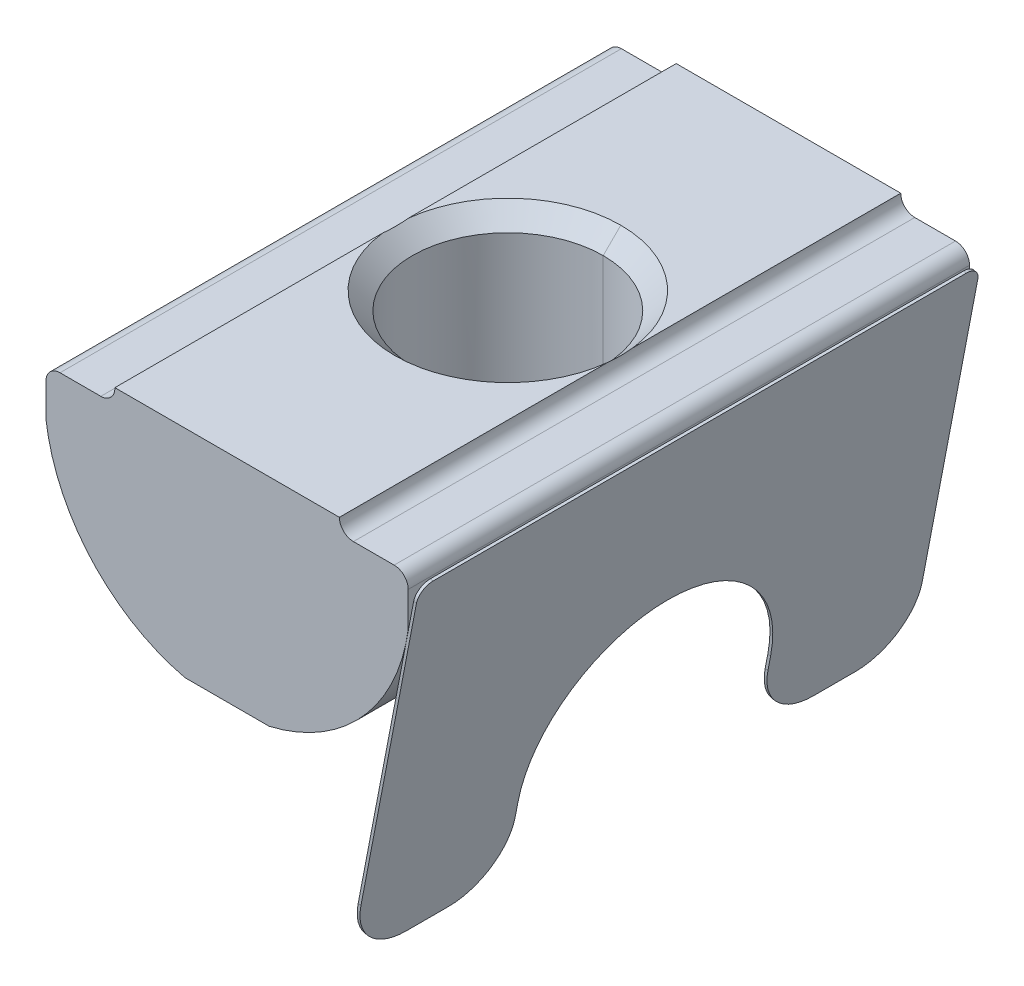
ISO-10303-21;
HEADER;
FILE_DESCRIPTION(('STEP AP214'),'2;1');
FILE_NAME('part.step','',(''),(''),'','','');
FILE_SCHEMA(('AUTOMOTIVE_DESIGN { 1 0 10303 214 1 1 1 1 }'));
ENDSEC;
DATA;
#1=APPLICATION_CONTEXT('core data for automotive mechanical design processes');
#2=APPLICATION_PROTOCOL_DEFINITION('international standard','automotive_design',2000,#1);
#3=PRODUCT_CONTEXT('',#1,'mechanical');
#4=PRODUCT('Part','Part','',(#3));
#5=PRODUCT_RELATED_PRODUCT_CATEGORY('part','',(#4));
#6=PRODUCT_DEFINITION_FORMATION('','',#4);
#7=PRODUCT_DEFINITION_CONTEXT('part definition',#1,'design');
#8=PRODUCT_DEFINITION('design','',#6,#7);
#9=PRODUCT_DEFINITION_SHAPE('','',#8);
#10=(LENGTH_UNIT() NAMED_UNIT(*) SI_UNIT(.MILLI.,.METRE.));
#11=(NAMED_UNIT(*) PLANE_ANGLE_UNIT() SI_UNIT($,.RADIAN.));
#12=(NAMED_UNIT(*) SI_UNIT($,.STERADIAN.) SOLID_ANGLE_UNIT());
#13=UNCERTAINTY_MEASURE_WITH_UNIT(LENGTH_MEASURE(1.E-05),#10,'distance_accuracy_value','');
#14=(GEOMETRIC_REPRESENTATION_CONTEXT(3) GLOBAL_UNCERTAINTY_ASSIGNED_CONTEXT((#13)) GLOBAL_UNIT_ASSIGNED_CONTEXT((#10,
#11,#12)) REPRESENTATION_CONTEXT('',''));
#15=CARTESIAN_POINT('',(0.,0.,0.));
#16=DIRECTION('',(0.,0.,1.));
#17=DIRECTION('',(1.,0.,0.));
#18=AXIS2_PLACEMENT_3D('',#15,#16,#17);
#19=CARTESIAN_POINT('',(3.55473304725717,-9.51138151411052,2.1819255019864));
#20=DIRECTION('',(0.982107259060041,-0.188322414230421,0.));
#21=DIRECTION('',(0.,0.,-1.));
#22=AXIS2_PLACEMENT_3D('',#19,#20,#21);
#23=PLANE('',#22);
#24=CARTESIAN_POINT('',(3.55473304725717,-9.51138151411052,2.1819255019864));
#25=DIRECTION('',(-0.982107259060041,0.188322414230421,0.));
#26=DIRECTION('',(0.,0.,1.));
#27=AXIS2_PLACEMENT_3D('',#24,#25,#26);
#28=CIRCLE('',#27,4.5);
#29=CARTESIAN_POINT('',(3.55473304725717,-9.51138151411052,6.6819255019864));
#30=VERTEX_POINT('',#29);
#31=CARTESIAN_POINT('',(3.55473304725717,-9.51138151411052,-2.31807449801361));
#32=VERTEX_POINT('',#31);
#33=EDGE_CURVE('P0_E274',#30,#32,#28,.T.);
#34=ORIENTED_EDGE('',*,*,#33,.F.);
#35=DIRECTION('',(0.188322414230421,0.982107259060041,0.));
#36=VECTOR('',#35,1.);
#37=CARTESIAN_POINT('',(3.55473304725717,-9.51138151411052,6.6819255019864));
#38=LINE('',#37,#36);
#39=CARTESIAN_POINT('',(3.46057184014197,-10.0024351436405,6.6819255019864));
#40=VERTEX_POINT('',#39);
#41=EDGE_CURVE('P0_E20',#40,#30,#38,.T.);
#42=ORIENTED_EDGE('',*,*,#41,.F.);
#43=CARTESIAN_POINT('',(3.46057184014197,-10.0024351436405,8.6819255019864));
#44=DIRECTION('',(0.982107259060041,-0.188322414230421,0.));
#45=DIRECTION('',(0.,0.,1.));
#46=AXIS2_PLACEMENT_3D('',#43,#44,#45);
#47=CIRCLE('',#46,2.);
#48=CARTESIAN_POINT('',(3.08392701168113,-11.9666496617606,8.68192550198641));
#49=VERTEX_POINT('',#48);
#50=EDGE_CURVE('P0_E251',#49,#40,#47,.T.);
#51=ORIENTED_EDGE('',*,*,#50,.F.);
#52=DIRECTION('',(0.,0.,-1.));
#53=VECTOR('',#52,1.);
#54=CARTESIAN_POINT('',(3.08392701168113,-11.9666496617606,8.68192550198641));
#55=LINE('',#54,#53);
#56=CARTESIAN_POINT('',(3.08392701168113,-11.9666496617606,10.1819255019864));
#57=VERTEX_POINT('',#56);
#58=EDGE_CURVE('P0_E242',#57,#49,#55,.T.);
#59=ORIENTED_EDGE('',*,*,#58,.F.);
#60=CARTESIAN_POINT('',(3.46057184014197,-10.0024351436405,10.1819255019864));
#61=DIRECTION('',(0.982107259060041,-0.188322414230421,0.));
#62=DIRECTION('',(0.,0.,1.));
#63=AXIS2_PLACEMENT_3D('',#60,#61,#62);
#64=CIRCLE('',#63,2.);
#65=CARTESIAN_POINT('',(3.46057184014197,-10.0024351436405,12.1819255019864));
#66=VERTEX_POINT('',#65);
#67=EDGE_CURVE('P0_E157',#66,#57,#64,.T.);
#68=ORIENTED_EDGE('',*,*,#67,.F.);
#69=DIRECTION('',(-0.188322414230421,-0.982107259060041,0.));
#70=VECTOR('',#69,1.);
#71=CARTESIAN_POINT('',(5.43795718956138,0.309691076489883,12.1819255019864));
#72=LINE('',#71,#70);
#73=CARTESIAN_POINT('',(5.43795718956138,0.309691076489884,12.1819255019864));
#74=VERTEX_POINT('',#73);
#75=EDGE_CURVE('P0_E151',#74,#66,#72,.T.);
#76=ORIENTED_EDGE('',*,*,#75,.F.);
#77=CARTESIAN_POINT('',(5.43795718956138,0.309691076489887,11.6819255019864));
#78=DIRECTION('',(0.982107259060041,-0.188322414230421,0.));
#79=DIRECTION('',(0.,0.,-1.));
#80=AXIS2_PLACEMENT_3D('',#77,#78,#79);
#81=CIRCLE('',#80,0.5);
#82=CARTESIAN_POINT('',(5.53211839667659,0.800744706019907,11.6819255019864));
#83=VERTEX_POINT('',#82);
#84=EDGE_CURVE('P0_E154',#83,#74,#81,.T.);
#85=ORIENTED_EDGE('',*,*,#84,.F.);
#86=DIRECTION('',(0.,0.,1.));
#87=VECTOR('',#86,1.);
#88=CARTESIAN_POINT('',(5.53211839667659,0.800744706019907,-7.3180744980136));
#89=LINE('',#88,#87);
#90=CARTESIAN_POINT('',(5.53211839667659,0.800744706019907,-7.3180744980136));
#91=VERTEX_POINT('',#90);
#92=EDGE_CURVE('P0_E206',#91,#83,#89,.T.);
#93=ORIENTED_EDGE('',*,*,#92,.F.);
#94=CARTESIAN_POINT('',(5.43795718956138,0.309691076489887,-7.31807449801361));
#95=DIRECTION('',(0.982107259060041,-0.188322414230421,0.));
#96=DIRECTION('',(0.,0.,1.));
#97=AXIS2_PLACEMENT_3D('',#94,#95,#96);
#98=CIRCLE('',#97,0.5);
#99=CARTESIAN_POINT('',(5.43795718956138,0.309691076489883,-7.81807449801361));
#100=VERTEX_POINT('',#99);
#101=EDGE_CURVE('P0_E213',#100,#91,#98,.T.);
#102=ORIENTED_EDGE('',*,*,#101,.F.);
#103=DIRECTION('',(0.188322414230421,0.982107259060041,0.));
#104=VECTOR('',#103,1.);
#105=CARTESIAN_POINT('',(5.43795718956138,0.309691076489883,-7.81807449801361));
#106=LINE('',#105,#104);
#107=CARTESIAN_POINT('',(3.46057184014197,-10.0024351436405,-7.81807449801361));
#108=VERTEX_POINT('',#107);
#109=EDGE_CURVE('P0_E196',#108,#100,#106,.T.);
#110=ORIENTED_EDGE('',*,*,#109,.F.);
#111=CARTESIAN_POINT('',(3.46057184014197,-10.0024351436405,-5.8180744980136));
#112=DIRECTION('',(0.982107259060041,-0.188322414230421,0.));
#113=DIRECTION('',(0.,0.,-1.));
#114=AXIS2_PLACEMENT_3D('',#111,#112,#113);
#115=CIRCLE('',#114,2.);
#116=CARTESIAN_POINT('',(3.08392701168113,-11.9666496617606,-5.81807449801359));
#117=VERTEX_POINT('',#116);
#118=EDGE_CURVE('P0_E191',#117,#108,#115,.T.);
#119=ORIENTED_EDGE('',*,*,#118,.F.);
#120=DIRECTION('',(0.,0.,-1.));
#121=VECTOR('',#120,1.);
#122=CARTESIAN_POINT('',(3.08392701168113,-11.9666496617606,-5.81807449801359));
#123=LINE('',#122,#121);
#124=CARTESIAN_POINT('',(3.08392701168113,-11.9666496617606,-4.31807449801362));
#125=VERTEX_POINT('',#124);
#126=EDGE_CURVE('P0_E296',#125,#117,#123,.T.);
#127=ORIENTED_EDGE('',*,*,#126,.F.);
#128=CARTESIAN_POINT('',(3.46057184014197,-10.0024351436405,-4.3180744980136));
#129=DIRECTION('',(0.982107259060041,-0.188322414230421,0.));
#130=DIRECTION('',(0.,0.,1.));
#131=AXIS2_PLACEMENT_3D('',#128,#129,#130);
#132=CIRCLE('',#131,2.);
#133=CARTESIAN_POINT('',(3.46057184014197,-10.0024351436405,-2.31807449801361));
#134=VERTEX_POINT('',#133);
#135=EDGE_CURVE('P0_E310',#134,#125,#132,.T.);
#136=ORIENTED_EDGE('',*,*,#135,.F.);
#137=DIRECTION('',(-0.188322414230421,-0.982107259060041,0.));
#138=VECTOR('',#137,1.);
#139=CARTESIAN_POINT('',(3.55473304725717,-9.51138151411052,-2.31807449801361));
#140=LINE('',#139,#138);
#141=EDGE_CURVE('P0_E278',#32,#134,#140,.T.);
#142=ORIENTED_EDGE('',*,*,#141,.F.);
#143=EDGE_LOOP('',(#34,#42,#51,#59,#68,#76,#85,#93,#102,#110,#119,#127,#136,#142));
#144=FACE_BOUND('',#143,.T.);
#145=ADVANCED_FACE('P0_F17',(#144),#23,.F.);
#146=CARTESIAN_POINT('',(3.65294377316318,-9.53021375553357,2.1819255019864));
#147=DIRECTION('',(0.982107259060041,-0.188322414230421,0.));
#148=DIRECTION('',(0.,0.,-1.));
#149=AXIS2_PLACEMENT_3D('',#146,#147,#148);
#150=PLANE('',#149);
#151=CARTESIAN_POINT('',(3.65294377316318,-9.53021375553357,2.1819255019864));
#152=DIRECTION('',(-0.982107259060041,0.188322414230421,0.));
#153=DIRECTION('',(0.,0.,1.));
#154=AXIS2_PLACEMENT_3D('',#151,#152,#153);
#155=CIRCLE('',#154,4.5);
#156=CARTESIAN_POINT('',(3.65294377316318,-9.53021375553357,6.6819255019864));
#157=VERTEX_POINT('',#156);
#158=CARTESIAN_POINT('',(3.65294377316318,-9.53021375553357,-2.31807449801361));
#159=VERTEX_POINT('',#158);
#160=EDGE_CURVE('P0_E276',#157,#159,#155,.T.);
#161=ORIENTED_EDGE('',*,*,#160,.T.);
#162=DIRECTION('',(-0.188322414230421,-0.982107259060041,0.));
#163=VECTOR('',#162,1.);
#164=CARTESIAN_POINT('',(3.65294377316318,-9.53021375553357,-2.31807449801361));
#165=LINE('',#164,#163);
#166=CARTESIAN_POINT('',(3.55878256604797,-10.0212673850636,-2.31807449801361));
#167=VERTEX_POINT('',#166);
#168=EDGE_CURVE('P0_E291',#159,#167,#165,.T.);
#169=ORIENTED_EDGE('',*,*,#168,.T.);
#170=CARTESIAN_POINT('',(3.55878256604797,-10.0212673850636,-4.3180744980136));
#171=DIRECTION('',(0.982107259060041,-0.188322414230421,0.));
#172=DIRECTION('',(0.,0.,1.));
#173=AXIS2_PLACEMENT_3D('',#170,#171,#172);
#174=CIRCLE('',#173,2.);
#175=CARTESIAN_POINT('',(3.18213773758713,-11.9854819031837,-4.31807449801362));
#176=VERTEX_POINT('',#175);
#177=EDGE_CURVE('P0_E302',#167,#176,#174,.T.);
#178=ORIENTED_EDGE('',*,*,#177,.T.);
#179=DIRECTION('',(0.,0.,-1.));
#180=VECTOR('',#179,1.);
#181=CARTESIAN_POINT('',(3.18213773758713,-11.9854819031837,-5.81807449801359));
#182=LINE('',#181,#180);
#183=CARTESIAN_POINT('',(3.18213773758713,-11.9854819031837,-5.81807449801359));
#184=VERTEX_POINT('',#183);
#185=EDGE_CURVE('P0_E189',#176,#184,#182,.T.);
#186=ORIENTED_EDGE('',*,*,#185,.T.);
#187=CARTESIAN_POINT('',(3.55878256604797,-10.0212673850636,-5.8180744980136));
#188=DIRECTION('',(0.982107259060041,-0.188322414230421,0.));
#189=DIRECTION('',(0.,0.,-1.));
#190=AXIS2_PLACEMENT_3D('',#187,#188,#189);
#191=CIRCLE('',#190,2.);
#192=CARTESIAN_POINT('',(3.55878256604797,-10.0212673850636,-7.81807449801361));
#193=VERTEX_POINT('',#192);
#194=EDGE_CURVE('P0_E201',#184,#193,#191,.T.);
#195=ORIENTED_EDGE('',*,*,#194,.T.);
#196=DIRECTION('',(0.188322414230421,0.982107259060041,0.));
#197=VECTOR('',#196,1.);
#198=CARTESIAN_POINT('',(5.53616791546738,0.290858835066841,-7.81807449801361));
#199=LINE('',#198,#197);
#200=CARTESIAN_POINT('',(5.53616791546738,0.290858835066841,-7.81807449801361));
#201=VERTEX_POINT('',#200);
#202=EDGE_CURVE('P0_E205',#193,#201,#199,.T.);
#203=ORIENTED_EDGE('',*,*,#202,.T.);
#204=CARTESIAN_POINT('',(5.53616791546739,0.290858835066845,-7.31807449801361));
#205=DIRECTION('',(0.982107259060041,-0.188322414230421,0.));
#206=DIRECTION('',(0.,0.,1.));
#207=AXIS2_PLACEMENT_3D('',#204,#205,#206);
#208=CIRCLE('',#207,0.5);
#209=CARTESIAN_POINT('',(5.63032912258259,0.781912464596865,-7.3180744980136));
#210=VERTEX_POINT('',#209);
#211=EDGE_CURVE('P0_E209',#201,#210,#208,.T.);
#212=ORIENTED_EDGE('',*,*,#211,.T.);
#213=DIRECTION('',(0.,0.,1.));
#214=VECTOR('',#213,1.);
#215=CARTESIAN_POINT('',(5.63032912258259,0.781912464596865,-7.3180744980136));
#216=LINE('',#215,#214);
#217=CARTESIAN_POINT('',(5.63032912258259,0.781912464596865,11.6819255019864));
#218=VERTEX_POINT('',#217);
#219=EDGE_CURVE('P0_E179',#210,#218,#216,.T.);
#220=ORIENTED_EDGE('',*,*,#219,.T.);
#221=CARTESIAN_POINT('',(5.53616791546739,0.290858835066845,11.6819255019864));
#222=DIRECTION('',(0.982107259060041,-0.188322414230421,0.));
#223=DIRECTION('',(0.,0.,-1.));
#224=AXIS2_PLACEMENT_3D('',#221,#222,#223);
#225=CIRCLE('',#224,0.5);
#226=CARTESIAN_POINT('',(5.53616791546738,0.290858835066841,12.1819255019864));
#227=VERTEX_POINT('',#226);
#228=EDGE_CURVE('P0_E163',#218,#227,#225,.T.);
#229=ORIENTED_EDGE('',*,*,#228,.T.);
#230=DIRECTION('',(-0.188322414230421,-0.982107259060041,0.));
#231=VECTOR('',#230,1.);
#232=CARTESIAN_POINT('',(5.53616791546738,0.290858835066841,12.1819255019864));
#233=LINE('',#232,#231);
#234=CARTESIAN_POINT('',(3.55878256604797,-10.0212673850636,12.1819255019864));
#235=VERTEX_POINT('',#234);
#236=EDGE_CURVE('P0_E169',#227,#235,#233,.T.);
#237=ORIENTED_EDGE('',*,*,#236,.T.);
#238=CARTESIAN_POINT('',(3.55878256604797,-10.0212673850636,10.1819255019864));
#239=DIRECTION('',(0.982107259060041,-0.188322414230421,0.));
#240=DIRECTION('',(0.,0.,1.));
#241=AXIS2_PLACEMENT_3D('',#238,#239,#240);
#242=CIRCLE('',#241,2.);
#243=CARTESIAN_POINT('',(3.18213773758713,-11.9854819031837,10.1819255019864));
#244=VERTEX_POINT('',#243);
#245=EDGE_CURVE('P0_E238',#235,#244,#242,.T.);
#246=ORIENTED_EDGE('',*,*,#245,.T.);
#247=DIRECTION('',(0.,0.,-1.));
#248=VECTOR('',#247,1.);
#249=CARTESIAN_POINT('',(3.18213773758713,-11.9854819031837,8.68192550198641));
#250=LINE('',#249,#248);
#251=CARTESIAN_POINT('',(3.18213773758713,-11.9854819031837,8.68192550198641));
#252=VERTEX_POINT('',#251);
#253=EDGE_CURVE('P0_E247',#244,#252,#250,.T.);
#254=ORIENTED_EDGE('',*,*,#253,.T.);
#255=CARTESIAN_POINT('',(3.55878256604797,-10.0212673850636,8.6819255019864));
#256=DIRECTION('',(0.982107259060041,-0.188322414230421,0.));
#257=DIRECTION('',(0.,0.,1.));
#258=AXIS2_PLACEMENT_3D('',#255,#256,#257);
#259=CIRCLE('',#258,2.);
#260=CARTESIAN_POINT('',(3.55878256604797,-10.0212673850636,6.6819255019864));
#261=VERTEX_POINT('',#260);
#262=EDGE_CURVE('P0_E257',#252,#261,#259,.T.);
#263=ORIENTED_EDGE('',*,*,#262,.T.);
#264=DIRECTION('',(0.188322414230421,0.982107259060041,0.));
#265=VECTOR('',#264,1.);
#266=CARTESIAN_POINT('',(3.65294377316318,-9.53021375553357,6.6819255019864));
#267=LINE('',#266,#265);
#268=EDGE_CURVE('P0_E11',#261,#157,#267,.T.);
#269=ORIENTED_EDGE('',*,*,#268,.T.);
#270=EDGE_LOOP('',(#161,#169,#178,#186,#195,#203,#212,#220,#229,#237,#246,#254,#263,#269));
#271=FACE_BOUND('',#270,.T.);
#272=ADVANCED_FACE('P0_F330',(#271),#150,.T.);
#273=CARTESIAN_POINT('',(3.65294377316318,-9.53021375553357,6.6819255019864));
#274=DIRECTION('',(0.,0.,1.));
#275=DIRECTION('',(0.,-1.,0.));
#276=AXIS2_PLACEMENT_3D('',#273,#274,#275);
#277=PLANE('',#276);
#278=ORIENTED_EDGE('',*,*,#41,.T.);
#279=DIRECTION('',(-0.982107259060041,0.188322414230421,0.));
#280=VECTOR('',#279,1.);
#281=CARTESIAN_POINT('',(3.65294377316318,-9.53021375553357,6.6819255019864));
#282=LINE('',#281,#280);
#283=EDGE_CURVE('P0_E268',#157,#30,#282,.T.);
#284=ORIENTED_EDGE('',*,*,#283,.F.);
#285=ORIENTED_EDGE('',*,*,#268,.F.);
#286=DIRECTION('',(-0.982107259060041,0.188322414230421,0.));
#287=VECTOR('',#286,1.);
#288=CARTESIAN_POINT('',(3.55878256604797,-10.0212673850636,6.6819255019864));
#289=LINE('',#288,#287);
#290=EDGE_CURVE('P0_E255',#261,#40,#289,.T.);
#291=ORIENTED_EDGE('',*,*,#290,.T.);
#292=EDGE_LOOP('',(#278,#284,#285,#291));
#293=FACE_BOUND('',#292,.T.);
#294=ADVANCED_FACE('P0_F267',(#293),#277,.F.);
#295=CARTESIAN_POINT('',(3.55878256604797,-10.0212673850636,8.6819255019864));
#296=DIRECTION('',(-0.982107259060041,0.188322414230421,0.));
#297=DIRECTION('',(0.,0.,-1.));
#298=AXIS2_PLACEMENT_3D('',#295,#296,#297);
#299=CYLINDRICAL_SURFACE('',#298,2.);
#300=ORIENTED_EDGE('',*,*,#50,.T.);
#301=ORIENTED_EDGE('',*,*,#290,.F.);
#302=ORIENTED_EDGE('',*,*,#262,.F.);
#303=DIRECTION('',(-0.982107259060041,0.188322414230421,0.));
#304=VECTOR('',#303,1.);
#305=CARTESIAN_POINT('',(3.18213773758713,-11.9854819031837,8.68192550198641));
#306=LINE('',#305,#304);
#307=EDGE_CURVE('P0_E243',#252,#49,#306,.T.);
#308=ORIENTED_EDGE('',*,*,#307,.T.);
#309=EDGE_LOOP('',(#300,#301,#302,#308));
#310=FACE_BOUND('',#309,.T.);
#311=ADVANCED_FACE('P0_F526',(#310),#299,.T.);
#312=CARTESIAN_POINT('',(3.18213773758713,-11.9854819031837,8.68192550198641));
#313=DIRECTION('',(0.188322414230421,0.982107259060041,0.));
#314=DIRECTION('',(0.,0.,-1.));
#315=AXIS2_PLACEMENT_3D('',#312,#313,#314);
#316=PLANE('',#315);
#317=ORIENTED_EDGE('',*,*,#58,.T.);
#318=ORIENTED_EDGE('',*,*,#307,.F.);
#319=ORIENTED_EDGE('',*,*,#253,.F.);
#320=DIRECTION('',(-0.982107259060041,0.188322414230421,0.));
#321=VECTOR('',#320,1.);
#322=CARTESIAN_POINT('',(3.18213773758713,-11.9854819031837,10.1819255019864));
#323=LINE('',#322,#321);
#324=EDGE_CURVE('P0_E234',#244,#57,#323,.T.);
#325=ORIENTED_EDGE('',*,*,#324,.T.);
#326=EDGE_LOOP('',(#317,#318,#319,#325));
#327=FACE_BOUND('',#326,.T.);
#328=ADVANCED_FACE('P0_F521',(#327),#316,.F.);
#329=CARTESIAN_POINT('',(3.55878256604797,-10.0212673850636,10.1819255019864));
#330=DIRECTION('',(-0.982107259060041,0.188322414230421,0.));
#331=DIRECTION('',(0.,0.,-1.));
#332=AXIS2_PLACEMENT_3D('',#329,#330,#331);
#333=CYLINDRICAL_SURFACE('',#332,2.);
#334=ORIENTED_EDGE('',*,*,#67,.T.);
#335=ORIENTED_EDGE('',*,*,#324,.F.);
#336=ORIENTED_EDGE('',*,*,#245,.F.);
#337=DIRECTION('',(-0.982107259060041,0.188322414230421,0.));
#338=VECTOR('',#337,1.);
#339=CARTESIAN_POINT('',(3.55878256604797,-10.0212673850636,12.1819255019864));
#340=LINE('',#339,#338);
#341=EDGE_CURVE('P0_E162',#235,#66,#340,.T.);
#342=ORIENTED_EDGE('',*,*,#341,.T.);
#343=EDGE_LOOP('',(#334,#335,#336,#342));
#344=FACE_BOUND('',#343,.T.);
#345=ADVANCED_FACE('P0_F525',(#344),#333,.T.);
#346=CARTESIAN_POINT('',(5.53616791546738,0.290858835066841,12.1819255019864));
#347=DIRECTION('',(0.,0.,-1.));
#348=DIRECTION('',(0.,-1.,0.));
#349=AXIS2_PLACEMENT_3D('',#346,#347,#348);
#350=PLANE('',#349);
#351=ORIENTED_EDGE('',*,*,#75,.T.);
#352=ORIENTED_EDGE('',*,*,#341,.F.);
#353=ORIENTED_EDGE('',*,*,#236,.F.);
#354=DIRECTION('',(-0.982107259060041,0.188322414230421,0.));
#355=VECTOR('',#354,1.);
#356=CARTESIAN_POINT('',(5.53616791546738,0.290858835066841,12.1819255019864));
#357=LINE('',#356,#355);
#358=EDGE_CURVE('P0_E166',#227,#74,#357,.T.);
#359=ORIENTED_EDGE('',*,*,#358,.T.);
#360=EDGE_LOOP('',(#351,#352,#353,#359));
#361=FACE_BOUND('',#360,.T.);
#362=ADVANCED_FACE('P0_F167',(#361),#350,.F.);
#363=CARTESIAN_POINT('',(5.53616791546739,0.290858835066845,11.6819255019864));
#364=DIRECTION('',(-0.982107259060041,0.188322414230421,0.));
#365=DIRECTION('',(0.,0.,-1.));
#366=AXIS2_PLACEMENT_3D('',#363,#364,#365);
#367=CYLINDRICAL_SURFACE('',#366,0.5);
#368=ORIENTED_EDGE('',*,*,#84,.T.);
#369=ORIENTED_EDGE('',*,*,#358,.F.);
#370=ORIENTED_EDGE('',*,*,#228,.F.);
#371=DIRECTION('',(-0.982107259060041,0.188322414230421,0.));
#372=VECTOR('',#371,1.);
#373=CARTESIAN_POINT('',(5.63032912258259,0.781912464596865,11.6819255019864));
#374=LINE('',#373,#372);
#375=EDGE_CURVE('P0_E176',#218,#83,#374,.T.);
#376=ORIENTED_EDGE('',*,*,#375,.T.);
#377=EDGE_LOOP('',(#368,#369,#370,#376));
#378=FACE_BOUND('',#377,.T.);
#379=ADVANCED_FACE('P0_F174',(#378),#367,.T.);
#380=CARTESIAN_POINT('',(5.63032912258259,0.781912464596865,-7.3180744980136));
#381=DIRECTION('',(-0.188322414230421,-0.982107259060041,0.));
#382=DIRECTION('',(-0.982107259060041,0.188322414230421,0.));
#383=AXIS2_PLACEMENT_3D('',#380,#381,#382);
#384=PLANE('',#383);
#385=ORIENTED_EDGE('',*,*,#92,.T.);
#386=ORIENTED_EDGE('',*,*,#375,.F.);
#387=ORIENTED_EDGE('',*,*,#219,.F.);
#388=DIRECTION('',(-0.982107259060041,0.188322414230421,0.));
#389=VECTOR('',#388,1.);
#390=CARTESIAN_POINT('',(5.63032912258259,0.781912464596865,-7.3180744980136));
#391=LINE('',#390,#389);
#392=EDGE_CURVE('P0_E217',#210,#91,#391,.T.);
#393=ORIENTED_EDGE('',*,*,#392,.T.);
#394=EDGE_LOOP('',(#385,#386,#387,#393));
#395=FACE_BOUND('',#394,.T.);
#396=ADVANCED_FACE('P0_F612',(#395),#384,.F.);
#397=CARTESIAN_POINT('',(5.53616791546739,0.290858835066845,-7.31807449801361));
#398=DIRECTION('',(-0.982107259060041,0.188322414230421,0.));
#399=DIRECTION('',(0.,0.,-1.));
#400=AXIS2_PLACEMENT_3D('',#397,#398,#399);
#401=CYLINDRICAL_SURFACE('',#400,0.5);
#402=ORIENTED_EDGE('',*,*,#101,.T.);
#403=ORIENTED_EDGE('',*,*,#392,.F.);
#404=ORIENTED_EDGE('',*,*,#211,.F.);
#405=DIRECTION('',(-0.982107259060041,0.188322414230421,0.));
#406=VECTOR('',#405,1.);
#407=CARTESIAN_POINT('',(5.53616791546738,0.290858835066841,-7.81807449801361));
#408=LINE('',#407,#406);
#409=EDGE_CURVE('P0_E200',#201,#100,#408,.T.);
#410=ORIENTED_EDGE('',*,*,#409,.T.);
#411=EDGE_LOOP('',(#402,#403,#404,#410));
#412=FACE_BOUND('',#411,.T.);
#413=ADVANCED_FACE('P0_F593',(#412),#401,.T.);
#414=CARTESIAN_POINT('',(5.53616791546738,0.290858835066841,-7.81807449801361));
#415=DIRECTION('',(0.,0.,1.));
#416=DIRECTION('',(0.,-1.,0.));
#417=AXIS2_PLACEMENT_3D('',#414,#415,#416);
#418=PLANE('',#417);
#419=ORIENTED_EDGE('',*,*,#109,.T.);
#420=ORIENTED_EDGE('',*,*,#409,.F.);
#421=ORIENTED_EDGE('',*,*,#202,.F.);
#422=DIRECTION('',(-0.982107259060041,0.188322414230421,0.));
#423=VECTOR('',#422,1.);
#424=CARTESIAN_POINT('',(3.55878256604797,-10.0212673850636,-7.81807449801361));
#425=LINE('',#424,#423);
#426=EDGE_CURVE('P0_E195',#193,#108,#425,.T.);
#427=ORIENTED_EDGE('',*,*,#426,.T.);
#428=EDGE_LOOP('',(#419,#420,#421,#427));
#429=FACE_BOUND('',#428,.T.);
#430=ADVANCED_FACE('P0_F581',(#429),#418,.F.);
#431=CARTESIAN_POINT('',(3.55878256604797,-10.0212673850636,-5.8180744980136));
#432=DIRECTION('',(-0.982107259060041,0.188322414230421,0.));
#433=DIRECTION('',(0.,0.,-1.));
#434=AXIS2_PLACEMENT_3D('',#431,#432,#433);
#435=CYLINDRICAL_SURFACE('',#434,2.);
#436=ORIENTED_EDGE('',*,*,#118,.T.);
#437=ORIENTED_EDGE('',*,*,#426,.F.);
#438=ORIENTED_EDGE('',*,*,#194,.F.);
#439=DIRECTION('',(-0.982107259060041,0.188322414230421,0.));
#440=VECTOR('',#439,1.);
#441=CARTESIAN_POINT('',(3.18213773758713,-11.9854819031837,-5.81807449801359));
#442=LINE('',#441,#440);
#443=EDGE_CURVE('P0_E293',#184,#117,#442,.T.);
#444=ORIENTED_EDGE('',*,*,#443,.T.);
#445=EDGE_LOOP('',(#436,#437,#438,#444));
#446=FACE_BOUND('',#445,.T.);
#447=ADVANCED_FACE('P0_F559',(#446),#435,.T.);
#448=CARTESIAN_POINT('',(3.18213773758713,-11.9854819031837,-5.81807449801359));
#449=DIRECTION('',(0.188322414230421,0.982107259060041,0.));
#450=DIRECTION('',(0.,0.,-1.));
#451=AXIS2_PLACEMENT_3D('',#448,#449,#450);
#452=PLANE('',#451);
#453=ORIENTED_EDGE('',*,*,#126,.T.);
#454=ORIENTED_EDGE('',*,*,#443,.F.);
#455=ORIENTED_EDGE('',*,*,#185,.F.);
#456=DIRECTION('',(-0.982107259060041,0.188322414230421,0.));
#457=VECTOR('',#456,1.);
#458=CARTESIAN_POINT('',(3.18213773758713,-11.9854819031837,-4.31807449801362));
#459=LINE('',#458,#457);
#460=EDGE_CURVE('P0_E314',#176,#125,#459,.T.);
#461=ORIENTED_EDGE('',*,*,#460,.T.);
#462=EDGE_LOOP('',(#453,#454,#455,#461));
#463=FACE_BOUND('',#462,.T.);
#464=ADVANCED_FACE('P0_F336',(#463),#452,.F.);
#465=CARTESIAN_POINT('',(3.55878256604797,-10.0212673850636,-4.3180744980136));
#466=DIRECTION('',(-0.982107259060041,0.188322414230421,0.));
#467=DIRECTION('',(0.,0.,-1.));
#468=AXIS2_PLACEMENT_3D('',#465,#466,#467);
#469=CYLINDRICAL_SURFACE('',#468,2.);
#470=ORIENTED_EDGE('',*,*,#135,.T.);
#471=ORIENTED_EDGE('',*,*,#460,.F.);
#472=ORIENTED_EDGE('',*,*,#177,.F.);
#473=DIRECTION('',(-0.982107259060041,0.188322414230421,0.));
#474=VECTOR('',#473,1.);
#475=CARTESIAN_POINT('',(3.55878256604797,-10.0212673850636,-2.31807449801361));
#476=LINE('',#475,#474);
#477=EDGE_CURVE('P0_E308',#167,#134,#476,.T.);
#478=ORIENTED_EDGE('',*,*,#477,.T.);
#479=EDGE_LOOP('',(#470,#471,#472,#478));
#480=FACE_BOUND('',#479,.T.);
#481=ADVANCED_FACE('P0_F334',(#480),#469,.T.);
#482=CARTESIAN_POINT('',(3.65294377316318,-9.53021375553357,-2.31807449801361));
#483=DIRECTION('',(0.,0.,-1.));
#484=DIRECTION('',(0.,-1.,0.));
#485=AXIS2_PLACEMENT_3D('',#482,#483,#484);
#486=PLANE('',#485);
#487=ORIENTED_EDGE('',*,*,#141,.T.);
#488=ORIENTED_EDGE('',*,*,#477,.F.);
#489=ORIENTED_EDGE('',*,*,#168,.F.);
#490=DIRECTION('',(-0.982107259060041,0.188322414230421,0.));
#491=VECTOR('',#490,1.);
#492=CARTESIAN_POINT('',(3.65294377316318,-9.53021375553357,-2.31807449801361));
#493=LINE('',#492,#491);
#494=EDGE_CURVE('P0_E283',#159,#32,#493,.T.);
#495=ORIENTED_EDGE('',*,*,#494,.T.);
#496=EDGE_LOOP('',(#487,#488,#489,#495));
#497=FACE_BOUND('',#496,.T.);
#498=ADVANCED_FACE('P0_F512',(#497),#486,.F.);
#499=CARTESIAN_POINT('',(3.65294377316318,-9.53021375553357,2.1819255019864));
#500=DIRECTION('',(-0.982107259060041,0.188322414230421,0.));
#501=DIRECTION('',(0.,0.,-1.));
#502=AXIS2_PLACEMENT_3D('',#499,#500,#501);
#503=CYLINDRICAL_SURFACE('',#502,4.5);
#504=ORIENTED_EDGE('',*,*,#33,.T.);
#505=ORIENTED_EDGE('',*,*,#494,.F.);
#506=ORIENTED_EDGE('',*,*,#160,.F.);
#507=ORIENTED_EDGE('',*,*,#283,.T.);
#508=EDGE_LOOP('',(#504,#505,#506,#507));
#509=FACE_BOUND('',#508,.T.);
#510=ADVANCED_FACE('P0_F272',(#509),#503,.F.);
#511=CLOSED_SHELL('',(#145,#272,#294,#311,#328,#345,#362,#379,#396,#413,#430,#447,#464,#481,
#498,#510));
#512=MANIFOLD_SOLID_BREP('P0_B1',#511);
#513=CARTESIAN_POINT('',(-1.2083959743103,1.57785343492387,2.18192550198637));
#514=DIRECTION('',(0.,1.,0.));
#515=DIRECTION('',(0.,0.,1.));
#516=AXIS2_PLACEMENT_3D('',#513,#514,#515);
#517=CONICAL_SURFACE('',#516,4.025,0.785398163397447);
#518=DIRECTION('',(0.,0.707106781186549,-0.707106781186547));
#519=VECTOR('',#518,1.);
#520=CARTESIAN_POINT('',(-1.2083959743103,1.57785343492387,-1.84307449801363));
#521=LINE('',#520,#519);
#522=CARTESIAN_POINT('',(-1.2083959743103,0.952853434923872,-1.21807449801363));
#523=VERTEX_POINT('',#522);
#524=CARTESIAN_POINT('',(-1.2083959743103,1.57785343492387,-1.84307449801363));
#525=VERTEX_POINT('',#524);
#526=EDGE_CURVE('P1_E498',#523,#525,#521,.T.);
#527=ORIENTED_EDGE('',*,*,#526,.F.);
#528=CARTESIAN_POINT('',(-1.2083959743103,0.952853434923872,2.18192550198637));
#529=DIRECTION('',(0.,1.,0.));
#530=DIRECTION('',(0.,0.,1.));
#531=AXIS2_PLACEMENT_3D('',#528,#529,#530);
#532=CIRCLE('',#531,3.4);
#533=CARTESIAN_POINT('',(-1.2083959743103,0.952853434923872,5.58192550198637));
#534=VERTEX_POINT('',#533);
#535=EDGE_CURVE('P1_E10',#534,#523,#532,.T.);
#536=ORIENTED_EDGE('',*,*,#535,.F.);
#537=DIRECTION('',(0.,0.707106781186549,0.707106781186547));
#538=VECTOR('',#537,1.);
#539=CARTESIAN_POINT('',(-1.2083959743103,1.57785343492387,6.20692550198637));
#540=LINE('',#539,#538);
#541=CARTESIAN_POINT('',(-1.2083959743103,1.57785343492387,6.20692550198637));
#542=VERTEX_POINT('',#541);
#543=EDGE_CURVE('P1_E511',#534,#542,#540,.T.);
#544=ORIENTED_EDGE('',*,*,#543,.T.);
#545=CARTESIAN_POINT('',(-1.2083959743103,1.57785343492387,2.18192550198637));
#546=DIRECTION('',(0.,1.,0.));
#547=DIRECTION('',(0.,0.,1.));
#548=AXIS2_PLACEMENT_3D('',#545,#546,#547);
#549=CIRCLE('',#548,4.025);
#550=CARTESIAN_POINT('',(2.7916040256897,1.57785343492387,2.62983732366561));
#551=VERTEX_POINT('',#550);
#552=EDGE_CURVE('P1_E241',#542,#551,#549,.T.);
#553=ORIENTED_EDGE('',*,*,#552,.T.);
#554=CARTESIAN_POINT('',(2.7916040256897,1.57785343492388,1.73401368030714));
#555=CARTESIAN_POINT('',(2.79160735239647,1.57370466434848,1.77128714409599));
#556=CARTESIAN_POINT('',(2.79165578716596,1.57006908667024,1.80861783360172));
#557=CARTESIAN_POINT('',(2.79178987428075,1.56383962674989,1.88327937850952));
#558=CARTESIAN_POINT('',(2.79187544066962,1.56124336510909,1.92061003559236));
#559=CARTESIAN_POINT('',(2.79203117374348,1.55709187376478,1.99527155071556));
#560=CARTESIAN_POINT('',(2.79210136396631,1.55553504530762,2.03260231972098));
#561=CARTESIAN_POINT('',(2.79219827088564,1.55346020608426,2.10726390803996));
#562=CARTESIAN_POINT('',(2.79222502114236,1.55294139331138,2.14459470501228));
#563=CARTESIAN_POINT('',(2.79222502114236,1.55294139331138,2.21925629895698));
#564=CARTESIAN_POINT('',(2.79219827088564,1.55346020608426,2.25658709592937));
#565=CARTESIAN_POINT('',(2.79210136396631,1.55553504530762,2.33124868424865));
#566=CARTESIAN_POINT('',(2.79203117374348,1.55709187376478,2.36857945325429));
#567=CARTESIAN_POINT('',(2.79187544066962,1.5612433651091,2.44324096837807));
#568=CARTESIAN_POINT('',(2.79178987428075,1.5638396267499,2.48057162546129));
#569=CARTESIAN_POINT('',(2.79165578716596,1.57006908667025,2.55523317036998));
#570=CARTESIAN_POINT('',(2.79160735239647,1.57370466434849,2.59256385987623));
#571=CARTESIAN_POINT('',(2.7916040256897,1.57785343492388,2.62983732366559));
#572=B_SPLINE_CURVE_WITH_KNOTS('',3,(#554,#555,#556,#557,#558,#559,#560,#561,#562,#563,#564,
#565,#566,#567,#568,#569,#570,#571),.UNSPECIFIED.,.F.,.F.,(4,2,2,2,2,2,2,2,4),(0.,
0.112507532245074,0.22475599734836,0.336831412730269,0.448820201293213,0.560808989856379,
0.67288440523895,0.785132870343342,0.897640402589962),.UNSPECIFIED.);
#573=CARTESIAN_POINT('',(2.7916040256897,1.57785343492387,1.73401368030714));
#574=VERTEX_POINT('',#573);
#575=EDGE_CURVE('P1_E233',#574,#551,#572,.T.);
#576=ORIENTED_EDGE('',*,*,#575,.F.);
#577=CARTESIAN_POINT('',(-1.2083959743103,1.57785343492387,2.18192550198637));
#578=DIRECTION('',(0.,1.,0.));
#579=DIRECTION('',(0.,0.,1.));
#580=AXIS2_PLACEMENT_3D('',#577,#578,#579);
#581=CIRCLE('',#580,4.025);
#582=EDGE_CURVE('P1_E238',#574,#525,#581,.T.);
#583=ORIENTED_EDGE('',*,*,#582,.T.);
#584=EDGE_LOOP('',(#527,#536,#544,#553,#576,#583));
#585=FACE_BOUND('',#584,.T.);
#586=ADVANCED_FACE('P1_F16',(#585),#517,.F.);
#587=CARTESIAN_POINT('',(-1.2083959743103,-5.49714656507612,2.18192550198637));
#588=DIRECTION('',(0.,-1.,0.));
#589=DIRECTION('',(0.,0.,-1.));
#590=AXIS2_PLACEMENT_3D('',#587,#588,#589);
#591=CONICAL_SURFACE('',#590,3.4,0.785398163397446);
#592=CARTESIAN_POINT('',(-1.2083959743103,-6.12214656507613,2.18192550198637));
#593=DIRECTION('',(0.,1.,0.));
#594=DIRECTION('',(0.,0.,1.));
#595=AXIS2_PLACEMENT_3D('',#592,#593,#594);
#596=CIRCLE('',#595,4.025);
#597=CARTESIAN_POINT('',(-2.7083959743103,-6.12214656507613,5.91697904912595));
#598=VERTEX_POINT('',#597);
#599=CARTESIAN_POINT('',(0.2916040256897,-6.12214656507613,5.91697904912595));
#600=VERTEX_POINT('',#599);
#601=EDGE_CURVE('P1_E53',#598,#600,#596,.T.);
#602=ORIENTED_EDGE('',*,*,#601,.F.);
#603=CARTESIAN_POINT('',(-4.33514872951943,-5.49714656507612,3.51737194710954));
#604=CARTESIAN_POINT('',(-4.31905825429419,-5.50595813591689,3.57749171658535));
#605=CARTESIAN_POINT('',(-4.30187068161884,-5.5152848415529,3.63724253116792));
#606=CARTESIAN_POINT('',(-4.26531287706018,-5.53488254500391,3.75586487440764));
#607=CARTESIAN_POINT('',(-4.24594431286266,-5.54515282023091,3.81473703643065));
#608=CARTESIAN_POINT('',(-4.20499409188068,-5.56657448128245,3.93160235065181));
#609=CARTESIAN_POINT('',(-4.18341055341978,-5.57772661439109,3.98959470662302));
#610=CARTESIAN_POINT('',(-4.1380003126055,-5.60083797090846,4.10470164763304));
#611=CARTESIAN_POINT('',(-4.11416820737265,-5.6127991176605,4.16181371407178));
#612=CARTESIAN_POINT('',(-4.06408422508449,-5.63751935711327,4.27549618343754));
#613=CARTESIAN_POINT('',(-4.03781066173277,-5.65028519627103,4.33205556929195));
#614=CARTESIAN_POINT('',(-3.98316031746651,-5.67635019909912,4.44365277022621));
#615=CARTESIAN_POINT('',(-3.95479489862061,-5.68964632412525,4.49869685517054));
#616=CARTESIAN_POINT('',(-3.89593093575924,-5.71668497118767,4.60726447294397));
#617=CARTESIAN_POINT('',(-3.86544006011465,-5.73042580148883,4.66079258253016));
#618=CARTESIAN_POINT('',(-3.80229630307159,-5.75826004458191,4.76632982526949));
#619=CARTESIAN_POINT('',(-3.76964731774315,-5.77235279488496,4.81834146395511));
#620=CARTESIAN_POINT('',(-3.70178553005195,-5.80094838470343,4.92141558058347));
#621=CARTESIAN_POINT('',(-3.66654848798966,-5.81545402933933,4.97246133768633));
#622=CARTESIAN_POINT('',(-3.59419989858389,-5.84445461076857,5.07229180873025));
#623=CARTESIAN_POINT('',(-3.55711385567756,-5.85894783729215,5.12109548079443));
#624=CARTESIAN_POINT('',(-3.48104940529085,-5.88782951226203,5.21644318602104));
#625=CARTESIAN_POINT('',(-3.44209223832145,-5.90221765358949,5.26300423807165));
#626=CARTESIAN_POINT('',(-3.36227102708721,-5.93079026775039,5.35386850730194));
#627=CARTESIAN_POINT('',(-3.32142370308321,-5.94497545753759,5.39818618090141));
#628=CARTESIAN_POINT('',(-3.23544926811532,-5.97383175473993,5.48700334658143));
#629=CARTESIAN_POINT('',(-3.19021018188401,-5.98849111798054,5.531398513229));
#630=CARTESIAN_POINT('',(-3.09812072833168,-6.01716996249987,5.61699070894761));
#631=CARTESIAN_POINT('',(-3.05131138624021,-6.03119610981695,5.65822957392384));
#632=CARTESIAN_POINT('',(-2.95608405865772,-6.05851568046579,5.73751115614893));
#633=CARTESIAN_POINT('',(-2.90770039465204,-6.07181690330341,5.77559231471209));
#634=CARTESIAN_POINT('',(-2.80934172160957,-6.09758955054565,5.84856493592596));
#635=CARTESIAN_POINT('',(-2.75939377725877,-6.1100691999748,5.88349000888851));
#636=CARTESIAN_POINT('',(-2.70839597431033,-6.12214656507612,5.91697904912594));
#637=B_SPLINE_CURVE_WITH_KNOTS('',3,(#603,#604,#605,#606,#607,#608,#609,#610,#611,#612,#613,
#614,#615,#616,#617,#618,#619,#620,#621,#622,#623,#624,#625,#626,#627,#628,#629,#630,#631,#632,
#633,#634,#635,#636),.UNSPECIFIED.,.F.,.F.,(4,2,2,2,2,2,2,2,2,2,2,2,2,2,2,2,4),(0.,
0.188556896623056,0.376970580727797,0.565545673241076,0.754586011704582,0.945504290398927,
1.13545272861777,1.32474817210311,1.51371074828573,1.70475070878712,1.89364458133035,
2.08075007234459,2.26643522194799,2.46151846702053,2.65325073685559,2.84212871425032,
3.02867188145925),.UNSPECIFIED.);
#638=CARTESIAN_POINT('',(-4.33514872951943,-5.49714656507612,3.51737194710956));
#639=VERTEX_POINT('',#638);
#640=EDGE_CURVE('P1_E335',#639,#598,#637,.T.);
#641=ORIENTED_EDGE('',*,*,#640,.F.);
#642=CARTESIAN_POINT('',(-1.2083959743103,-5.49714656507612,2.18192550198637));
#643=DIRECTION('',(0.,1.,0.));
#644=DIRECTION('',(0.,0.,1.));
#645=AXIS2_PLACEMENT_3D('',#642,#643,#644);
#646=CIRCLE('',#645,3.4);
#647=CARTESIAN_POINT('',(-1.2083959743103,-5.49714656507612,5.58192550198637));
#648=VERTEX_POINT('',#647);
#649=EDGE_CURVE('P1_E339',#639,#648,#646,.T.);
#650=ORIENTED_EDGE('',*,*,#649,.T.);
#651=CARTESIAN_POINT('',(-1.2083959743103,-5.49714656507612,2.18192550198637));
#652=DIRECTION('',(0.,1.,0.));
#653=DIRECTION('',(0.,0.,1.));
#654=AXIS2_PLACEMENT_3D('',#651,#652,#653);
#655=CIRCLE('',#654,3.4);
#656=CARTESIAN_POINT('',(1.91835678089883,-5.49714656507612,3.51737194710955));
#657=VERTEX_POINT('',#656);
#658=EDGE_CURVE('P1_E28',#648,#657,#655,.T.);
#659=ORIENTED_EDGE('',*,*,#658,.T.);
#660=CARTESIAN_POINT('',(0.291604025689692,-6.12214656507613,5.91697904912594));
#661=CARTESIAN_POINT('',(0.342130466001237,-6.11018081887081,5.88379930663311));
#662=CARTESIAN_POINT('',(0.391626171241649,-6.09782025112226,5.84920943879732));
#663=CARTESIAN_POINT('',(0.48911399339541,-6.07229823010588,5.7769592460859));
#664=CARTESIAN_POINT('',(0.537079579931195,-6.05912869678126,5.73926594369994));
#665=CARTESIAN_POINT('',(0.631504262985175,-6.03208200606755,5.66081191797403));
#666=CARTESIAN_POINT('',(0.677929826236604,-6.01819718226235,5.62001357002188));
#667=CARTESIAN_POINT('',(0.769284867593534,-5.98980767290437,5.53535443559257));
#668=CARTESIAN_POINT('',(0.814174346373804,-5.97529640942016,5.49145276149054));
#669=CARTESIAN_POINT('',(0.900221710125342,-5.94649024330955,5.40289938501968));
#670=CARTESIAN_POINT('',(0.941452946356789,-5.93220320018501,5.35831625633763));
#671=CARTESIAN_POINT('',(1.02201902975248,-5.90341821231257,5.26687512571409));
#672=CARTESIAN_POINT('',(1.0613364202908,-5.88891949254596,5.22000199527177));
#673=CARTESIAN_POINT('',(1.1380989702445,-5.85980995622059,5.12398436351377));
#674=CARTESIAN_POINT('',(1.17552200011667,-5.84519943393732,5.07482210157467));
#675=CARTESIAN_POINT('',(1.24852325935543,-5.81595919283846,4.97422912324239));
#676=CARTESIAN_POINT('',(1.28407496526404,-5.80133122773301,4.92277867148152));
#677=CARTESIAN_POINT('',(1.35207061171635,-5.77268753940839,4.81956422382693));
#678=CARTESIAN_POINT('',(1.38456879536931,-5.75866555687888,4.76783765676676));
#679=CARTESIAN_POINT('',(1.44743722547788,-5.73096624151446,4.66287572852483));
#680=CARTESIAN_POINT('',(1.47780328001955,-5.7172896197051,4.60963766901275));
#681=CARTESIAN_POINT('',(1.53644370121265,-5.69037104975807,4.50165573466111));
#682=CARTESIAN_POINT('',(1.56471017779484,-5.67713083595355,4.44690714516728));
#683=CARTESIAN_POINT('',(1.61918825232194,-5.65116785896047,4.33590657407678));
#684=CARTESIAN_POINT('',(1.64538834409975,-5.63844816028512,4.27964823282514));
#685=CARTESIAN_POINT('',(1.69563009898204,-5.61367109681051,4.16593391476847));
#686=CARTESIAN_POINT('',(1.71966865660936,-5.60161469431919,4.10847635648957));
#687=CARTESIAN_POINT('',(1.76546283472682,-5.57832133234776,3.99266085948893));
#688=CARTESIAN_POINT('',(1.78722382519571,-5.56708246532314,3.93430542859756));
#689=CARTESIAN_POINT('',(1.82850112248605,-5.54549714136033,3.81669659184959));
#690=CARTESIAN_POINT('',(1.84801918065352,-5.53514998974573,3.75744392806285));
#691=CARTESIAN_POINT('',(1.88484885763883,-5.51540955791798,3.63804323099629));
#692=CARTESIAN_POINT('',(1.90215858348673,-5.50601709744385,3.57789447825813));
#693=CARTESIAN_POINT('',(1.91835678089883,-5.49714656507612,3.51737194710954));
#694=B_SPLINE_CURVE_WITH_KNOTS('',3,(#660,#661,#662,#663,#664,#665,#666,#667,#668,#669,#670,
#671,#672,#673,#674,#675,#676,#677,#678,#679,#680,#681,#682,#683,#684,#685,#686,#687,#688,#689,
#690,#691,#692,#693),.UNSPECIFIED.,.F.,.F.,(4,2,2,2,2,2,2,2,2,2,2,2,2,2,2,2,4),(0.,
0.184820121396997,0.37195061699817,0.561897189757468,0.755143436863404,0.942226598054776,
1.13078050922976,1.32118265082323,1.51379963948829,1.70177528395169,1.89011071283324,
2.0791214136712,2.26911951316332,2.459386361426,2.64919398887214,2.83885238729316,
3.02867228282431),.UNSPECIFIED.);
#695=EDGE_CURVE('P1_E369',#600,#657,#694,.T.);
#696=ORIENTED_EDGE('',*,*,#695,.F.);
#697=EDGE_LOOP('',(#602,#641,#650,#659,#696));
#698=FACE_BOUND('',#697,.T.);
#699=ADVANCED_FACE('P1_F341',(#698),#591,.F.);
#700=CARTESIAN_POINT('',(-1.2083959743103,-5.49714656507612,2.18192550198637));
#701=DIRECTION('',(0.,-1.,0.));
#702=DIRECTION('',(0.,0.,-1.));
#703=AXIS2_PLACEMENT_3D('',#700,#701,#702);
#704=CONICAL_SURFACE('',#703,3.4,0.785398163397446);
#705=DIRECTION('',(0.,-0.707106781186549,-0.707106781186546));
#706=VECTOR('',#705,1.);
#707=CARTESIAN_POINT('',(-1.2083959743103,-5.49714656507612,-1.21807449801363));
#708=LINE('',#707,#706);
#709=CARTESIAN_POINT('',(-1.2083959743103,-5.49714656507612,-1.21807449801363));
#710=VERTEX_POINT('',#709);
#711=CARTESIAN_POINT('',(-1.2083959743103,-6.12214656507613,-1.84307449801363));
#712=VERTEX_POINT('',#711);
#713=EDGE_CURVE('P1_E521',#710,#712,#708,.T.);
#714=ORIENTED_EDGE('',*,*,#713,.F.);
#715=CARTESIAN_POINT('',(-1.2083959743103,-5.49714656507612,2.18192550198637));
#716=DIRECTION('',(0.,1.,0.));
#717=DIRECTION('',(0.,0.,1.));
#718=AXIS2_PLACEMENT_3D('',#715,#716,#717);
#719=CIRCLE('',#718,3.4);
#720=CARTESIAN_POINT('',(-4.33514872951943,-5.49714656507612,0.846479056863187));
#721=VERTEX_POINT('',#720);
#722=EDGE_CURVE('P1_E534',#710,#721,#719,.T.);
#723=ORIENTED_EDGE('',*,*,#722,.T.);
#724=CARTESIAN_POINT('',(-2.70839597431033,-6.12214656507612,-1.55312804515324));
#725=CARTESIAN_POINT('',(-2.75892241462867,-6.1101808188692,-1.51994830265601));
#726=CARTESIAN_POINT('',(-2.80841811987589,-6.09782025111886,-1.48535843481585));
#727=CARTESIAN_POINT('',(-2.90590594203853,-6.07229823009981,-1.41310824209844));
#728=CARTESIAN_POINT('',(-2.95387152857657,-6.05912869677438,-1.3754149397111));
#729=CARTESIAN_POINT('',(-3.0482962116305,-6.03208200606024,-1.29696091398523));
#730=CARTESIAN_POINT('',(-3.09472177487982,-6.01819718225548,-1.25616256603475));
#731=CARTESIAN_POINT('',(-3.1860768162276,-5.98980767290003,-1.17150343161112));
#732=CARTESIAN_POINT('',(-3.23096629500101,-5.97529640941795,-1.1276017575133));
#733=CARTESIAN_POINT('',(-3.31701365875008,-5.94649024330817,-1.03904838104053));
#734=CARTESIAN_POINT('',(-3.35824489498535,-5.93220320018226,-0.994465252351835));
#735=CARTESIAN_POINT('',(-3.43881097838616,-5.90341821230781,-0.903024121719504));
#736=CARTESIAN_POINT('',(-3.47812836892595,-5.88891949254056,-0.85615099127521));
#737=CARTESIAN_POINT('',(-3.5548909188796,-5.85980995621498,-0.76013335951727));
#738=CARTESIAN_POINT('',(-3.59231394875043,-5.84519943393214,-0.710971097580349));
#739=CARTESIAN_POINT('',(-3.66531520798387,-5.81595919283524,-0.610378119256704));
#740=CARTESIAN_POINT('',(-3.7008669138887,-5.8013312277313,-0.558927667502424));
#741=CARTESIAN_POINT('',(-3.76886256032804,-5.77268753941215,-0.455713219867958));
#742=CARTESIAN_POINT('',(-3.80136074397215,-5.75866555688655,-0.403986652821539));
#743=CARTESIAN_POINT('',(-3.86422917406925,-5.73096624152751,-0.299024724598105));
#744=CARTESIAN_POINT('',(-3.8945952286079,-5.71728961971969,-0.245786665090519));
#745=CARTESIAN_POINT('',(-3.95323564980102,-5.69037104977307,-0.137804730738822));
#746=CARTESIAN_POINT('',(-3.98150212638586,-5.6771308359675,-0.0830561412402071));
#747=CARTESIAN_POINT('',(-4.03598020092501,-5.65116785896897,0.0279444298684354));
#748=CARTESIAN_POINT('',(-4.06218029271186,-5.63844816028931,0.0842027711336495));
#749=CARTESIAN_POINT('',(-4.11242204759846,-5.61367109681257,0.197917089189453));
#750=CARTESIAN_POINT('',(-4.13646060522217,-5.60161469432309,0.255374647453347));
#751=CARTESIAN_POINT('',(-4.18225478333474,-5.57832133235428,0.371190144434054));
#752=CARTESIAN_POINT('',(-4.204015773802,-5.56708246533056,0.429545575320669));
#753=CARTESIAN_POINT('',(-4.24529307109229,-5.54549714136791,0.547154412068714));
#754=CARTESIAN_POINT('',(-4.26481112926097,-5.53514998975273,0.606407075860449));
#755=CARTESIAN_POINT('',(-4.3016408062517,-5.51540955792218,0.725807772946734));
#756=CARTESIAN_POINT('',(-4.31895053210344,-5.50601709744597,0.785956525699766));
#757=CARTESIAN_POINT('',(-4.33514872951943,-5.49714656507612,0.846479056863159));
#758=B_SPLINE_CURVE_WITH_KNOTS('',3,(#724,#725,#726,#727,#728,#729,#730,#731,#732,#733,#734,
#735,#736,#737,#738,#739,#740,#741,#742,#743,#744,#745,#746,#747,#748,#749,#750,#751,#752,#753,
#754,#755,#756,#757),.UNSPECIFIED.,.F.,.F.,(4,2,2,2,2,2,2,2,2,2,2,2,2,2,2,2,4),(0.,
0.184820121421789,0.371950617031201,0.561897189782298,0.755143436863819,0.942226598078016,
1.13078050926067,1.32118265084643,1.51379963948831,1.70177528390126,1.89011071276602,
2.07912141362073,2.26911951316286,2.45938636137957,2.6491939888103,2.83885238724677,
3.02867228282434),.UNSPECIFIED.);
#759=CARTESIAN_POINT('',(-2.7083959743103,-6.12214656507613,-1.55312804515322));
#760=VERTEX_POINT('',#759);
#761=EDGE_CURVE('P1_E295',#760,#721,#758,.T.);
#762=ORIENTED_EDGE('',*,*,#761,.F.);
#763=CARTESIAN_POINT('',(-1.2083959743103,-6.12214656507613,2.18192550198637));
#764=DIRECTION('',(0.,1.,0.));
#765=DIRECTION('',(0.,0.,1.));
#766=AXIS2_PLACEMENT_3D('',#763,#764,#765);
#767=CIRCLE('',#766,4.025);
#768=EDGE_CURVE('P1_E703',#712,#760,#767,.T.);
#769=ORIENTED_EDGE('',*,*,#768,.F.);
#770=EDGE_LOOP('',(#714,#723,#762,#769));
#771=FACE_BOUND('',#770,.T.);
#772=ADVANCED_FACE('P1_F350',(#771),#704,.F.);
#773=CARTESIAN_POINT('',(-1.2083959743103,1.57785343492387,2.18192550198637));
#774=DIRECTION('',(0.,1.,0.));
#775=DIRECTION('',(0.,0.,1.));
#776=AXIS2_PLACEMENT_3D('',#773,#774,#775);
#777=CYLINDRICAL_SURFACE('',#776,3.4);
#778=DIRECTION('',(0.,1.,0.));
#779=VECTOR('',#778,1.);
#780=CARTESIAN_POINT('',(-1.2083959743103,1.57785343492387,-1.21807449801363));
#781=LINE('',#780,#779);
#782=EDGE_CURVE('P1_E530',#710,#523,#781,.T.);
#783=ORIENTED_EDGE('',*,*,#782,.F.);
#784=CARTESIAN_POINT('',(-1.2083959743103,-5.49714656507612,2.18192550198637));
#785=DIRECTION('',(0.,1.,0.));
#786=DIRECTION('',(0.,0.,1.));
#787=AXIS2_PLACEMENT_3D('',#784,#785,#786);
#788=CIRCLE('',#787,3.4);
#789=CARTESIAN_POINT('',(1.91835678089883,-5.49714656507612,0.846479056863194));
#790=VERTEX_POINT('',#789);
#791=EDGE_CURVE('P1_E520',#790,#710,#788,.T.);
#792=ORIENTED_EDGE('',*,*,#791,.F.);
#793=CARTESIAN_POINT('',(1.91835678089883,-5.49714656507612,3.51737194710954));
#794=CARTESIAN_POINT('',(1.94077153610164,-5.48486879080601,3.46490303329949));
#795=CARTESIAN_POINT('',(1.96191533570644,-5.47311736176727,3.41176203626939));
#796=CARTESIAN_POINT('',(2.00134382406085,-5.45094812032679,3.30485854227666));
#797=CARTESIAN_POINT('',(2.01965783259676,-5.44051686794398,3.25110963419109));
#798=CARTESIAN_POINT('',(2.05347226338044,-5.42106947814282,3.14298943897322));
#799=CARTESIAN_POINT('',(2.06899498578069,-5.41204221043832,3.08862714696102));
#800=CARTESIAN_POINT('',(2.09727455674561,-5.39546554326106,2.97928737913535));
#801=CARTESIAN_POINT('',(2.1100459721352,-5.38790838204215,2.92431484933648));
#802=CARTESIAN_POINT('',(2.13312034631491,-5.37417010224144,2.81247352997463));
#803=CARTESIAN_POINT('',(2.14336652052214,-5.36802082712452,2.75558907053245));
#804=CARTESIAN_POINT('',(2.16089614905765,-5.35745292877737,2.64159736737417));
#805=CARTESIAN_POINT('',(2.16819894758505,-5.35302301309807,2.58449415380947));
#806=CARTESIAN_POINT('',(2.1798728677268,-5.34592255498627,2.47006906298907));
#807=CARTESIAN_POINT('',(2.1842535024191,-5.3432463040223,2.4127485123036));
#808=CARTESIAN_POINT('',(2.19010851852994,-5.33966610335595,2.29789139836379));
#809=CARTESIAN_POINT('',(2.19158225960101,-5.33876254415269,2.24035479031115));
#810=CARTESIAN_POINT('',(2.19162546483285,-5.33873607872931,2.12552709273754));
#811=CARTESIAN_POINT('',(2.19020737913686,-5.3396055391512,2.06823601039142));
#812=CARTESIAN_POINT('',(2.18446890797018,-5.34311469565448,1.95381721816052));
#813=CARTESIAN_POINT('',(2.18014668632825,-5.34575551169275,1.89668963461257));
#814=CARTESIAN_POINT('',(2.1686011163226,-5.35277887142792,1.78259766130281));
#815=CARTESIAN_POINT('',(2.1613658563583,-5.35716856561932,1.72563492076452));
#816=CARTESIAN_POINT('',(2.14398319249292,-5.36765018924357,1.61187076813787));
#817=CARTESIAN_POINT('',(2.13381419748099,-5.37375473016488,1.55507382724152));
#818=CARTESIAN_POINT('',(2.11082329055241,-5.38744765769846,1.44299596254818));
#819=CARTESIAN_POINT('',(2.09803824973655,-5.39501534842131,1.38770492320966));
#820=CARTESIAN_POINT('',(2.06969718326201,-5.41163302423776,1.27773033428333));
#821=CARTESIAN_POINT('',(2.05412619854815,-5.42069098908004,1.22305184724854));
#822=CARTESIAN_POINT('',(2.0201825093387,-5.44021745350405,1.11430081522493));
#823=CARTESIAN_POINT('',(2.00178694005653,-5.45069737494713,1.06023747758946));
#824=CARTESIAN_POINT('',(1.96216172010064,-5.4729804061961,0.952706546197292));
#825=CARTESIAN_POINT('',(1.94090202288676,-5.4847972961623,0.899252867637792));
#826=CARTESIAN_POINT('',(1.91835678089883,-5.49714656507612,0.84647905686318));
#827=B_SPLINE_CURVE_WITH_KNOTS('',3,(#793,#794,#795,#796,#797,#798,#799,#800,#801,#802,#803,
#804,#805,#806,#807,#808,#809,#810,#811,#812,#813,#814,#815,#816,#817,#818,#819,#820,#821,#822,
#823,#824,#825,#826),.UNSPECIFIED.,.F.,.F.,(4,2,2,2,2,2,2,2,2,2,2,2,2,2,2,2,4),(0.,
0.17507462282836,0.348192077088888,0.51985822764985,0.690591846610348,0.864871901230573,
1.03798712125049,1.21053597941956,1.38312284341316,1.5549682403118,1.72692239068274,
1.89958693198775,2.07355612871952,2.24522412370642,2.41784317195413,2.59194140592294,
2.76803364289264),.UNSPECIFIED.);
#828=EDGE_CURVE('P1_E382',#657,#790,#827,.T.);
#829=ORIENTED_EDGE('',*,*,#828,.F.);
#830=ORIENTED_EDGE('',*,*,#658,.F.);
#831=DIRECTION('',(0.,1.,0.));
#832=VECTOR('',#831,1.);
#833=CARTESIAN_POINT('',(-1.2083959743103,1.57785343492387,5.58192550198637));
#834=LINE('',#833,#832);
#835=EDGE_CURVE('P1_E526',#648,#534,#834,.T.);
#836=ORIENTED_EDGE('',*,*,#835,.T.);
#837=ORIENTED_EDGE('',*,*,#535,.T.);
#838=EDGE_LOOP('',(#783,#792,#829,#830,#836,#837));
#839=FACE_BOUND('',#838,.T.);
#840=ADVANCED_FACE('P1_F654',(#839),#777,.F.);
#841=CARTESIAN_POINT('',(3.2916040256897,1.57785343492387,12.1819255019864));
#842=DIRECTION('',(0.,0.,1.));
#843=DIRECTION('',(1.,0.,0.));
#844=AXIS2_PLACEMENT_3D('',#841,#842,#843);
#845=CYLINDRICAL_SURFACE('',#844,0.5);
#846=DIRECTION('',(0.,0.,-1.));
#847=VECTOR('',#846,1.);
#848=CARTESIAN_POINT('',(2.7916040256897,1.57785343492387,12.1819255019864));
#849=LINE('',#848,#847);
#850=CARTESIAN_POINT('',(2.7916040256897,1.57785343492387,-7.81807449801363));
#851=VERTEX_POINT('',#850);
#852=EDGE_CURVE('P1_E251',#574,#851,#849,.T.);
#853=ORIENTED_EDGE('',*,*,#852,.F.);
#854=ORIENTED_EDGE('',*,*,#575,.T.);
#855=DIRECTION('',(0.,0.,-1.));
#856=VECTOR('',#855,1.);
#857=CARTESIAN_POINT('',(2.7916040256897,1.57785343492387,12.1819255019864));
#858=LINE('',#857,#856);
#859=CARTESIAN_POINT('',(2.7916040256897,1.57785343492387,12.1819255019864));
#860=VERTEX_POINT('',#859);
#861=EDGE_CURVE('P1_E283',#860,#551,#858,.T.);
#862=ORIENTED_EDGE('',*,*,#861,.F.);
#863=CARTESIAN_POINT('',(3.2916040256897,1.57785343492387,12.1819255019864));
#864=DIRECTION('',(0.,0.,-1.));
#865=DIRECTION('',(1.,0.,0.));
#866=AXIS2_PLACEMENT_3D('',#863,#864,#865);
#867=CIRCLE('',#866,0.5);
#868=CARTESIAN_POINT('',(3.2916040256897,1.07785343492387,12.1819255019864));
#869=VERTEX_POINT('',#868);
#870=EDGE_CURVE('P1_E634',#869,#860,#867,.T.);
#871=ORIENTED_EDGE('',*,*,#870,.F.);
#872=DIRECTION('',(0.,0.,1.));
#873=VECTOR('',#872,1.);
#874=CARTESIAN_POINT('',(3.2916040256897,1.07785343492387,12.1819255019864));
#875=LINE('',#874,#873);
#876=CARTESIAN_POINT('',(3.2916040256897,1.07785343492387,-7.81807449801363));
#877=VERTEX_POINT('',#876);
#878=EDGE_CURVE('P1_E485',#877,#869,#875,.T.);
#879=ORIENTED_EDGE('',*,*,#878,.F.);
#880=CARTESIAN_POINT('',(3.2916040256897,1.57785343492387,-7.81807449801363));
#881=DIRECTION('',(0.,0.,1.));
#882=DIRECTION('',(1.,0.,0.));
#883=AXIS2_PLACEMENT_3D('',#880,#881,#882);
#884=CIRCLE('',#883,0.5);
#885=EDGE_CURVE('P1_E254',#851,#877,#884,.T.);
#886=ORIENTED_EDGE('',*,*,#885,.F.);
#887=EDGE_LOOP('',(#853,#854,#862,#871,#879,#886));
#888=FACE_BOUND('',#887,.T.);
#889=ADVANCED_FACE('P1_F252',(#888),#845,.F.);
#890=CARTESIAN_POINT('',(4.74266857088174,0.577853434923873,12.1819255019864));
#891=DIRECTION('',(0.,0.,-1.));
#892=DIRECTION('',(-1.,0.,0.));
#893=AXIS2_PLACEMENT_3D('',#890,#891,#892);
#894=CYLINDRICAL_SURFACE('',#893,0.5);
#895=CARTESIAN_POINT('',(4.74266857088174,0.577853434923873,12.1819255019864));
#896=DIRECTION('',(0.,0.,1.));
#897=DIRECTION('',(1.,0.,0.));
#898=AXIS2_PLACEMENT_3D('',#895,#896,#897);
#899=CIRCLE('',#898,0.5);
#900=CARTESIAN_POINT('',(5.24266857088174,0.577853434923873,12.1819255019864));
#901=VERTEX_POINT('',#900);
#902=CARTESIAN_POINT('',(4.74266857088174,1.07785343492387,12.1819255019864));
#903=VERTEX_POINT('',#902);
#904=EDGE_CURVE('P1_E631',#901,#903,#899,.T.);
#905=ORIENTED_EDGE('',*,*,#904,.F.);
#906=DIRECTION('',(0.,0.,1.));
#907=VECTOR('',#906,1.);
#908=CARTESIAN_POINT('',(5.24266857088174,0.577853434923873,12.1819255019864));
#909=LINE('',#908,#907);
#910=CARTESIAN_POINT('',(5.24266857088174,0.577853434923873,-7.81807449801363));
#911=VERTEX_POINT('',#910);
#912=EDGE_CURVE('P1_E580',#911,#901,#909,.T.);
#913=ORIENTED_EDGE('',*,*,#912,.F.);
#914=CARTESIAN_POINT('',(4.74266857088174,0.577853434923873,-7.81807449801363));
#915=DIRECTION('',(0.,0.,-1.));
#916=DIRECTION('',(1.,0.,0.));
#917=AXIS2_PLACEMENT_3D('',#914,#915,#916);
#918=CIRCLE('',#917,0.5);
#919=CARTESIAN_POINT('',(4.74266857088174,1.07785343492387,-7.81807449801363));
#920=VERTEX_POINT('',#919);
#921=EDGE_CURVE('P1_E247',#920,#911,#918,.T.);
#922=ORIENTED_EDGE('',*,*,#921,.F.);
#923=DIRECTION('',(0.,0.,-1.));
#924=VECTOR('',#923,1.);
#925=CARTESIAN_POINT('',(4.74266857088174,1.07785343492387,12.1819255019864));
#926=LINE('',#925,#924);
#927=EDGE_CURVE('P1_E552',#903,#920,#926,.T.);
#928=ORIENTED_EDGE('',*,*,#927,.F.);
#929=EDGE_LOOP('',(#905,#913,#922,#928));
#930=FACE_BOUND('',#929,.T.);
#931=ADVANCED_FACE('P1_F653',(#930),#894,.T.);
#932=CARTESIAN_POINT('',(-5.7083959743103,1.56049887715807,12.1819255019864));
#933=DIRECTION('',(0.,0.,1.));
#934=DIRECTION('',(1.,0.,0.));
#935=AXIS2_PLACEMENT_3D('',#932,#933,#934);
#936=CYLINDRICAL_SURFACE('',#935,0.5);
#937=DIRECTION('',(0.,0.,1.));
#938=VECTOR('',#937,1.);
#939=CARTESIAN_POINT('',(-5.2083959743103,1.56049887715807,12.1819255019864));
#940=LINE('',#939,#938);
#941=CARTESIAN_POINT('',(-5.20839597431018,1.56049887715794,2.42935628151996));
#942=VERTEX_POINT('',#941);
#943=CARTESIAN_POINT('',(-5.2083959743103,1.56049887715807,12.1819255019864));
#944=VERTEX_POINT('',#943);
#945=EDGE_CURVE('P1_E273',#942,#944,#940,.T.);
#946=ORIENTED_EDGE('',*,*,#945,.F.);
#947=CARTESIAN_POINT('',(-5.2083959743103,1.56049887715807,2.42935628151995));
#948=CARTESIAN_POINT('',(-5.20839629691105,1.55922634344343,2.40874603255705));
#949=CARTESIAN_POINT('',(-5.20840084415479,1.55811232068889,2.3881259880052));
#950=CARTESIAN_POINT('',(-5.20841343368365,1.55620278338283,2.34688589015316));
#951=CARTESIAN_POINT('',(-5.20842147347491,1.55540704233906,2.3262658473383));
#952=CARTESIAN_POINT('',(-5.20843610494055,1.55413404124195,2.28502575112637));
#953=CARTESIAN_POINT('',(-5.20844269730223,1.55365662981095,2.26440570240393));
#954=CARTESIAN_POINT('',(-5.20845180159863,1.55302015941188,2.22316560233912));
#955=CARTESIAN_POINT('',(-5.20845431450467,1.55286102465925,2.20254555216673));
#956=CARTESIAN_POINT('',(-5.20845431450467,1.55286102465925,2.1613054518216));
#957=CARTESIAN_POINT('',(-5.20845180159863,1.55302015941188,2.14068540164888));
#958=CARTESIAN_POINT('',(-5.20844269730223,1.55365662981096,2.09944530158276));
#959=CARTESIAN_POINT('',(-5.20843610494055,1.55413404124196,2.07882525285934));
#960=CARTESIAN_POINT('',(-5.20842147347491,1.55540704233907,2.03758515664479));
#961=CARTESIAN_POINT('',(-5.20841343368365,1.55620278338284,2.01696511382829));
#962=CARTESIAN_POINT('',(-5.20840084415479,1.55811232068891,1.97572501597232));
#963=CARTESIAN_POINT('',(-5.20839629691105,1.55922634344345,1.95510497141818));
#964=CARTESIAN_POINT('',(-5.2083959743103,1.56049887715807,1.93449472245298));
#965=B_SPLINE_CURVE_WITH_KNOTS('',3,(#947,#948,#949,#950,#951,#952,#953,#954,#955,#956,#957,
#958,#959,#960,#961,#962,#963,#964),.UNSPECIFIED.,.F.,.F.,(4,2,2,2,2,2,2,2,4),(0.,
0.0619478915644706,0.123851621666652,0.185725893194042,0.247585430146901,0.309444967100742,
0.371319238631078,0.43322296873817,0.495170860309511),.UNSPECIFIED.);
#966=CARTESIAN_POINT('',(-5.2083959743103,1.56049887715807,1.934494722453));
#967=VERTEX_POINT('',#966);
#968=EDGE_CURVE('P1_E473',#942,#967,#965,.T.);
#969=ORIENTED_EDGE('',*,*,#968,.T.);
#970=DIRECTION('',(0.,0.,1.));
#971=VECTOR('',#970,1.);
#972=CARTESIAN_POINT('',(-5.2083959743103,1.56049887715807,12.1819255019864));
#973=LINE('',#972,#971);
#974=CARTESIAN_POINT('',(-5.2083959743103,1.56049887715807,-7.81807449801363));
#975=VERTEX_POINT('',#974);
#976=EDGE_CURVE('P1_E478',#975,#967,#973,.T.);
#977=ORIENTED_EDGE('',*,*,#976,.F.);
#978=CARTESIAN_POINT('',(-5.7083959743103,1.56049887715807,-7.81807449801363));
#979=DIRECTION('',(0.,0.,1.));
#980=DIRECTION('',(1.,0.,0.));
#981=AXIS2_PLACEMENT_3D('',#978,#979,#980);
#982=CIRCLE('',#981,0.5);
#983=CARTESIAN_POINT('',(-5.7083959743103,1.06049887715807,-7.81807449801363));
#984=VERTEX_POINT('',#983);
#985=EDGE_CURVE('P1_E546',#984,#975,#982,.T.);
#986=ORIENTED_EDGE('',*,*,#985,.F.);
#987=DIRECTION('',(0.,0.,-1.));
#988=VECTOR('',#987,1.);
#989=CARTESIAN_POINT('',(-5.7083959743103,1.06049887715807,-7.81807449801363));
#990=LINE('',#989,#988);
#991=CARTESIAN_POINT('',(-5.7083959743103,1.06049887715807,12.1819255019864));
#992=VERTEX_POINT('',#991);
#993=EDGE_CURVE('P1_E608',#992,#984,#990,.T.);
#994=ORIENTED_EDGE('',*,*,#993,.F.);
#995=CARTESIAN_POINT('',(-5.7083959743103,1.56049887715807,12.1819255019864));
#996=DIRECTION('',(0.,0.,-1.));
#997=DIRECTION('',(1.,0.,0.));
#998=AXIS2_PLACEMENT_3D('',#995,#996,#997);
#999=CIRCLE('',#998,0.5);
#1000=EDGE_CURVE('P1_E547',#944,#992,#999,.T.);
#1001=ORIENTED_EDGE('',*,*,#1000,.F.);
#1002=EDGE_LOOP('',(#946,#969,#977,#986,#994,#1001));
#1003=FACE_BOUND('',#1002,.T.);
#1004=ADVANCED_FACE('P1_F1097',(#1003),#936,.F.);
#1005=CARTESIAN_POINT('',(-7.1617670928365,0.560498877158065,12.1819255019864));
#1006=DIRECTION('',(0.,0.,-1.));
#1007=DIRECTION('',(-1.,0.,0.));
#1008=AXIS2_PLACEMENT_3D('',#1005,#1006,#1007);
#1009=CYLINDRICAL_SURFACE('',#1008,0.5);
#1010=CARTESIAN_POINT('',(-7.1617670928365,0.560498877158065,12.1819255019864));
#1011=DIRECTION('',(0.,0.,1.));
#1012=DIRECTION('',(1.,0.,0.));
#1013=AXIS2_PLACEMENT_3D('',#1010,#1011,#1012);
#1014=CIRCLE('',#1013,0.5);
#1015=CARTESIAN_POINT('',(-7.1617670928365,1.06049887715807,12.1819255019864));
#1016=VERTEX_POINT('',#1015);
#1017=CARTESIAN_POINT('',(-7.6617670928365,0.560498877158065,12.1819255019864));
#1018=VERTEX_POINT('',#1017);
#1019=EDGE_CURVE('P1_E628',#1016,#1018,#1014,.T.);
#1020=ORIENTED_EDGE('',*,*,#1019,.F.);
#1021=DIRECTION('',(0.,0.,1.));
#1022=VECTOR('',#1021,1.);
#1023=CARTESIAN_POINT('',(-7.1617670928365,1.06049887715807,12.1819255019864));
#1024=LINE('',#1023,#1022);
#1025=CARTESIAN_POINT('',(-7.1617670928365,1.06049887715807,-7.81807449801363));
#1026=VERTEX_POINT('',#1025);
#1027=EDGE_CURVE('P1_E593',#1026,#1016,#1024,.T.);
#1028=ORIENTED_EDGE('',*,*,#1027,.F.);
#1029=CARTESIAN_POINT('',(-7.1617670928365,0.560498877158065,-7.81807449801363));
#1030=DIRECTION('',(0.,0.,-1.));
#1031=DIRECTION('',(1.,0.,0.));
#1032=AXIS2_PLACEMENT_3D('',#1029,#1030,#1031);
#1033=CIRCLE('',#1032,0.5);
#1034=CARTESIAN_POINT('',(-7.6617670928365,0.560498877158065,-7.81807449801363));
#1035=VERTEX_POINT('',#1034);
#1036=EDGE_CURVE('P1_E543',#1035,#1026,#1033,.T.);
#1037=ORIENTED_EDGE('',*,*,#1036,.F.);
#1038=DIRECTION('',(0.,0.,-1.));
#1039=VECTOR('',#1038,1.);
#1040=CARTESIAN_POINT('',(-7.6617670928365,0.560498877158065,12.1819255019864));
#1041=LINE('',#1040,#1039);
#1042=EDGE_CURVE('P1_E512',#1018,#1035,#1041,.T.);
#1043=ORIENTED_EDGE('',*,*,#1042,.F.);
#1044=EDGE_LOOP('',(#1020,#1028,#1037,#1043));
#1045=FACE_BOUND('',#1044,.T.);
#1046=ADVANCED_FACE('P1_F1087',(#1045),#1009,.T.);
#1047=CARTESIAN_POINT('',(-1.2083959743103,0.211619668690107,-7.81807449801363));
#1048=DIRECTION('',(0.,0.,1.));
#1049=DIRECTION('',(1.,0.,0.));
#1050=AXIS2_PLACEMENT_3D('',#1047,#1048,#1049);
#1051=PLANE('',#1050);
#1052=DIRECTION('',(0.,-1.,0.));
#1053=VECTOR('',#1052,1.);
#1054=CARTESIAN_POINT('',(-7.6617670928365,-0.637259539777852,-7.81807449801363));
#1055=LINE('',#1054,#1053);
#1056=CARTESIAN_POINT('',(-7.6617670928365,-0.637259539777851,-7.81807449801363));
#1057=VERTEX_POINT('',#1056);
#1058=EDGE_CURVE('P1_E516',#1035,#1057,#1055,.T.);
#1059=ORIENTED_EDGE('',*,*,#1058,.F.);
#1060=ORIENTED_EDGE('',*,*,#1036,.T.);
#1061=DIRECTION('',(-1.,0.,0.));
#1062=VECTOR('',#1061,1.);
#1063=CARTESIAN_POINT('',(-7.6617670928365,1.06049887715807,-7.81807449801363));
#1064=LINE('',#1063,#1062);
#1065=EDGE_CURVE('P1_E598',#984,#1026,#1064,.T.);
#1066=ORIENTED_EDGE('',*,*,#1065,.F.);
#1067=ORIENTED_EDGE('',*,*,#985,.T.);
#1068=DIRECTION('',(0.,-1.,0.));
#1069=VECTOR('',#1068,1.);
#1070=CARTESIAN_POINT('',(-5.2083959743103,1.57785343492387,-7.81807449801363));
#1071=LINE('',#1070,#1069);
#1072=CARTESIAN_POINT('',(-5.2083959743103,1.57785343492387,-7.81807449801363));
#1073=VERTEX_POINT('',#1072);
#1074=EDGE_CURVE('P1_E484',#1073,#975,#1071,.T.);
#1075=ORIENTED_EDGE('',*,*,#1074,.F.);
#1076=DIRECTION('',(-1.,0.,0.));
#1077=VECTOR('',#1076,1.);
#1078=CARTESIAN_POINT('',(-5.2083959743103,1.57785343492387,-7.81807449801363));
#1079=LINE('',#1078,#1077);
#1080=EDGE_CURVE('P1_E259',#851,#1073,#1079,.T.);
#1081=ORIENTED_EDGE('',*,*,#1080,.F.);
#1082=ORIENTED_EDGE('',*,*,#885,.T.);
#1083=DIRECTION('',(-1.,0.,0.));
#1084=VECTOR('',#1083,1.);
#1085=CARTESIAN_POINT('',(2.7916040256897,1.07785343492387,-7.81807449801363));
#1086=LINE('',#1085,#1084);
#1087=EDGE_CURVE('P1_E562',#920,#877,#1086,.T.);
#1088=ORIENTED_EDGE('',*,*,#1087,.F.);
#1089=ORIENTED_EDGE('',*,*,#921,.T.);
#1090=DIRECTION('',(0.,1.,0.));
#1091=VECTOR('',#1090,1.);
#1092=CARTESIAN_POINT('',(5.24266857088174,1.07785343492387,-7.81807449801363));
#1093=LINE('',#1092,#1091);
#1094=CARTESIAN_POINT('',(5.24266857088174,-0.654614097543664,-7.81807449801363));
#1095=VERTEX_POINT('',#1094);
#1096=EDGE_CURVE('P1_E576',#1095,#911,#1093,.T.);
#1097=ORIENTED_EDGE('',*,*,#1096,.F.);
#1098=CARTESIAN_POINT('',(-1.2083959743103,0.211619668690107,-7.81807449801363));
#1099=DIRECTION('',(0.,0.,1.));
#1100=DIRECTION('',(1.,0.,0.));
#1101=AXIS2_PLACEMENT_3D('',#1098,#1099,#1100);
#1102=CIRCLE('',#1101,6.50896264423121);
#1103=CARTESIAN_POINT('',(0.2916040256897,-6.12214656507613,-7.81807449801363));
#1104=VERTEX_POINT('',#1103);
#1105=EDGE_CURVE('P1_E565',#1104,#1095,#1102,.T.);
#1106=ORIENTED_EDGE('',*,*,#1105,.F.);
#1107=DIRECTION('',(1.,0.,0.));
#1108=VECTOR('',#1107,1.);
#1109=CARTESIAN_POINT('',(-2.7083959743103,-6.12214656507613,-7.81807449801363));
#1110=LINE('',#1109,#1108);
#1111=CARTESIAN_POINT('',(-2.7083959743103,-6.12214656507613,-7.81807449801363));
#1112=VERTEX_POINT('',#1111);
#1113=EDGE_CURVE('P1_E538',#1112,#1104,#1110,.T.);
#1114=ORIENTED_EDGE('',*,*,#1113,.F.);
#1115=CARTESIAN_POINT('',(-1.2083959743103,0.211619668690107,-7.81807449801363));
#1116=DIRECTION('',(0.,0.,1.));
#1117=DIRECTION('',(1.,0.,0.));
#1118=AXIS2_PLACEMENT_3D('',#1115,#1116,#1117);
#1119=CIRCLE('',#1118,6.50896264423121);
#1120=EDGE_CURVE('P1_E622',#1057,#1112,#1119,.T.);
#1121=ORIENTED_EDGE('',*,*,#1120,.F.);
#1122=EDGE_LOOP('',(#1059,#1060,#1066,#1067,#1075,#1081,#1082,#1088,#1089,#1097,#1106,#1114,#1121));
#1123=FACE_BOUND('',#1122,.T.);
#1124=ADVANCED_FACE('P1_F316',(#1123),#1051,.F.);
#1125=CARTESIAN_POINT('',(-1.2083959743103,0.211619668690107,12.1819255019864));
#1126=DIRECTION('',(0.,0.,1.));
#1127=DIRECTION('',(1.,0.,0.));
#1128=AXIS2_PLACEMENT_3D('',#1125,#1126,#1127);
#1129=PLANE('',#1128);
#1130=DIRECTION('',(-1.,0.,0.));
#1131=VECTOR('',#1130,1.);
#1132=CARTESIAN_POINT('',(-7.6617670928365,1.06049887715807,12.1819255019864));
#1133=LINE('',#1132,#1131);
#1134=EDGE_CURVE('P1_E597',#992,#1016,#1133,.T.);
#1135=ORIENTED_EDGE('',*,*,#1134,.T.);
#1136=ORIENTED_EDGE('',*,*,#1019,.T.);
#1137=DIRECTION('',(0.,-1.,0.));
#1138=VECTOR('',#1137,1.);
#1139=CARTESIAN_POINT('',(-7.6617670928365,-0.637259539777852,12.1819255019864));
#1140=LINE('',#1139,#1138);
#1141=CARTESIAN_POINT('',(-7.6617670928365,-0.637259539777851,12.1819255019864));
#1142=VERTEX_POINT('',#1141);
#1143=EDGE_CURVE('P1_E517',#1018,#1142,#1140,.T.);
#1144=ORIENTED_EDGE('',*,*,#1143,.T.);
#1145=CARTESIAN_POINT('',(-1.2083959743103,0.211619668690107,12.1819255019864));
#1146=DIRECTION('',(0.,0.,1.));
#1147=DIRECTION('',(1.,0.,0.));
#1148=AXIS2_PLACEMENT_3D('',#1145,#1146,#1147);
#1149=CIRCLE('',#1148,6.50896264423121);
#1150=CARTESIAN_POINT('',(-2.7083959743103,-6.12214656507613,12.1819255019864));
#1151=VERTEX_POINT('',#1150);
#1152=EDGE_CURVE('P1_E619',#1142,#1151,#1149,.T.);
#1153=ORIENTED_EDGE('',*,*,#1152,.T.);
#1154=DIRECTION('',(1.,0.,0.));
#1155=VECTOR('',#1154,1.);
#1156=CARTESIAN_POINT('',(-2.7083959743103,-6.12214656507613,12.1819255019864));
#1157=LINE('',#1156,#1155);
#1158=CARTESIAN_POINT('',(0.2916040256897,-6.12214656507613,12.1819255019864));
#1159=VERTEX_POINT('',#1158);
#1160=EDGE_CURVE('P1_E42',#1151,#1159,#1157,.T.);
#1161=ORIENTED_EDGE('',*,*,#1160,.T.);
#1162=CARTESIAN_POINT('',(-1.2083959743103,0.211619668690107,12.1819255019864));
#1163=DIRECTION('',(0.,0.,1.));
#1164=DIRECTION('',(1.,0.,0.));
#1165=AXIS2_PLACEMENT_3D('',#1162,#1163,#1164);
#1166=CIRCLE('',#1165,6.50896264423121);
#1167=CARTESIAN_POINT('',(5.24266857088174,-0.654614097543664,12.1819255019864));
#1168=VERTEX_POINT('',#1167);
#1169=EDGE_CURVE('P1_E370',#1159,#1168,#1166,.T.);
#1170=ORIENTED_EDGE('',*,*,#1169,.T.);
#1171=DIRECTION('',(0.,1.,0.));
#1172=VECTOR('',#1171,1.);
#1173=CARTESIAN_POINT('',(5.24266857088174,1.07785343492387,12.1819255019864));
#1174=LINE('',#1173,#1172);
#1175=EDGE_CURVE('P1_E553',#1168,#901,#1174,.T.);
#1176=ORIENTED_EDGE('',*,*,#1175,.T.);
#1177=ORIENTED_EDGE('',*,*,#904,.T.);
#1178=DIRECTION('',(-1.,0.,0.));
#1179=VECTOR('',#1178,1.);
#1180=CARTESIAN_POINT('',(2.7916040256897,1.07785343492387,12.1819255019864));
#1181=LINE('',#1180,#1179);
#1182=EDGE_CURVE('P1_E548',#903,#869,#1181,.T.);
#1183=ORIENTED_EDGE('',*,*,#1182,.T.);
#1184=ORIENTED_EDGE('',*,*,#870,.T.);
#1185=DIRECTION('',(-1.,0.,0.));
#1186=VECTOR('',#1185,1.);
#1187=CARTESIAN_POINT('',(-5.2083959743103,1.57785343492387,12.1819255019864));
#1188=LINE('',#1187,#1186);
#1189=CARTESIAN_POINT('',(-5.2083959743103,1.57785343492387,12.1819255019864));
#1190=VERTEX_POINT('',#1189);
#1191=EDGE_CURVE('P1_E288',#860,#1190,#1188,.T.);
#1192=ORIENTED_EDGE('',*,*,#1191,.T.);
#1193=DIRECTION('',(0.,-1.,0.));
#1194=VECTOR('',#1193,1.);
#1195=CARTESIAN_POINT('',(-5.2083959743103,1.57785343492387,12.1819255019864));
#1196=LINE('',#1195,#1194);
#1197=EDGE_CURVE('P1_E266',#1190,#944,#1196,.T.);
#1198=ORIENTED_EDGE('',*,*,#1197,.T.);
#1199=ORIENTED_EDGE('',*,*,#1000,.T.);
#1200=EDGE_LOOP('',(#1135,#1136,#1144,#1153,#1161,#1170,#1176,#1177,#1183,#1184,#1192,#1198,#1199));
#1201=FACE_BOUND('',#1200,.T.);
#1202=ADVANCED_FACE('P1_F314',(#1201),#1129,.T.);
#1203=CARTESIAN_POINT('',(-2.7083959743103,-6.12214656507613,12.1819255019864));
#1204=DIRECTION('',(0.,1.,0.));
#1205=DIRECTION('',(1.,0.,0.));
#1206=AXIS2_PLACEMENT_3D('',#1203,#1204,#1205);
#1207=PLANE('',#1206);
#1208=DIRECTION('',(0.,0.,-1.));
#1209=VECTOR('',#1208,1.);
#1210=CARTESIAN_POINT('',(-2.7083959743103,-6.12214656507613,12.1819255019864));
#1211=LINE('',#1210,#1209);
#1212=EDGE_CURVE('P1_E623',#1151,#598,#1211,.T.);
#1213=ORIENTED_EDGE('',*,*,#1212,.T.);
#1214=ORIENTED_EDGE('',*,*,#601,.T.);
#1215=DIRECTION('',(0.,0.,-1.));
#1216=VECTOR('',#1215,1.);
#1217=CARTESIAN_POINT('',(0.2916040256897,-6.12214656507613,12.1819255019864));
#1218=LINE('',#1217,#1216);
#1219=EDGE_CURVE('P1_E360',#1159,#600,#1218,.T.);
#1220=ORIENTED_EDGE('',*,*,#1219,.F.);
#1221=ORIENTED_EDGE('',*,*,#1160,.F.);
#1222=EDGE_LOOP('',(#1213,#1214,#1220,#1221));
#1223=FACE_BOUND('',#1222,.T.);
#1224=ADVANCED_FACE('P1_F313',(#1223),#1207,.F.);
#1225=CARTESIAN_POINT('',(-1.2083959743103,0.211619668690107,12.1819255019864));
#1226=DIRECTION('',(0.,0.,-1.));
#1227=DIRECTION('',(-1.,0.,0.));
#1228=AXIS2_PLACEMENT_3D('',#1225,#1226,#1227);
#1229=CYLINDRICAL_SURFACE('',#1228,6.50896264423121);
#1230=CARTESIAN_POINT('',(-4.33514872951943,-5.49714656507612,0.846479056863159));
#1231=CARTESIAN_POINT('',(-4.35756348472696,-5.48486879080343,0.898947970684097));
#1232=CARTESIAN_POINT('',(-4.37870728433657,-5.47311736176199,0.95208896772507));
#1233=CARTESIAN_POINT('',(-4.41813577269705,-5.45094812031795,1.05899246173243));
#1234=CARTESIAN_POINT('',(-4.43644978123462,-5.44051686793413,1.11274136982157));
#1235=CARTESIAN_POINT('',(-4.47026421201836,-5.42106947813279,1.22086156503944));
#1236=CARTESIAN_POINT('',(-4.4857869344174,-5.41204221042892,1.2752238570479));
#1237=CARTESIAN_POINT('',(-4.5140665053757,-5.39546554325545,1.38456362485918));
#1238=CARTESIAN_POINT('',(-4.52683792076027,-5.38790838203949,1.43953615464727));
#1239=CARTESIAN_POINT('',(-4.54991229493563,-5.37417010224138,1.55137747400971));
#1240=CARTESIAN_POINT('',(-4.56015846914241,-5.36802082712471,1.60826193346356));
#1241=CARTESIAN_POINT('',(-4.57768809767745,-5.35745292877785,1.72225363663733));
#1242=CARTESIAN_POINT('',(-4.58499089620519,-5.35302301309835,1.77935685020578));
#1243=CARTESIAN_POINT('',(-4.59666481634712,-5.34592255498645,1.89378194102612));
#1244=CARTESIAN_POINT('',(-4.60104545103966,-5.34324630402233,1.95110249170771));
#1245=CARTESIAN_POINT('',(-4.60690046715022,-5.33966610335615,2.06595960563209));
#1246=CARTESIAN_POINT('',(-4.60837420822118,-5.33876254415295,2.12349621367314));
#1247=CARTESIAN_POINT('',(-4.6084174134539,-5.33873607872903,2.23832391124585));
#1248=CARTESIAN_POINT('',(-4.60699932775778,-5.33960553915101,2.29561499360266));
#1249=CARTESIAN_POINT('',(-4.60126085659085,-5.34311469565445,2.41003378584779));
#1250=CARTESIAN_POINT('',(-4.59693863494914,-5.34575551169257,2.46716136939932));
#1251=CARTESIAN_POINT('',(-4.58539306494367,-5.35277887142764,2.58125334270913));
#1252=CARTESIAN_POINT('',(-4.57815780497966,-5.35716856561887,2.63821608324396));
#1253=CARTESIAN_POINT('',(-4.56077514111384,-5.36765018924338,2.75198023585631));
#1254=CARTESIAN_POINT('',(-4.55060614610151,-5.37375473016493,2.80877717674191));
#1255=CARTESIAN_POINT('',(-4.52761523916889,-5.38744765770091,2.92085504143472));
#1256=CARTESIAN_POINT('',(-4.51483019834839,-5.39501534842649,2.97614608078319));
#1257=CARTESIAN_POINT('',(-4.48648913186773,-5.41163302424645,3.08612066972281));
#1258=CARTESIAN_POINT('',(-4.47091814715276,-5.42069098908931,3.14079915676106));
#1259=CARTESIAN_POINT('',(-4.43697445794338,-5.44021745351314,3.24955018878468));
#1260=CARTESIAN_POINT('',(-4.41857888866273,-5.45069737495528,3.30361352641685));
#1261=CARTESIAN_POINT('',(-4.37895366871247,-5.47298040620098,3.41114445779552));
#1262=CARTESIAN_POINT('',(-4.35769397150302,-5.48479729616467,3.46459813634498));
#1263=CARTESIAN_POINT('',(-4.33514872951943,-5.49714656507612,3.51737194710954));
#1264=B_SPLINE_CURVE_WITH_KNOTS('',3,(#1230,#1231,#1232,#1233,#1234,#1235,#1236,#1237,#1238,
#1239,#1240,#1241,#1242,#1243,#1244,#1245,#1246,#1247,#1248,#1249,#1250,#1251,#1252,#1253,#1254,
#1255,#1256,#1257,#1258,#1259,#1260,#1261,#1262,#1263),.UNSPECIFIED.,.F.,.F.,(4,2,2,2,2,2,2,2,2,
2,2,2,2,2,2,2,4),(0.,0.175074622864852,0.348192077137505,0.519858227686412,0.690591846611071,
0.864871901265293,1.03798712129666,1.2105359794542,1.38312284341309,1.55496824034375,
1.72692239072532,1.89958693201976,2.07355612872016,2.24522412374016,2.417843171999,
2.59194140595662,2.76803364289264),.UNSPECIFIED.);
#1265=EDGE_CURVE('P1_E537',#721,#639,#1264,.T.);
#1266=ORIENTED_EDGE('',*,*,#1265,.T.);
#1267=ORIENTED_EDGE('',*,*,#640,.T.);
#1268=ORIENTED_EDGE('',*,*,#1212,.F.);
#1269=ORIENTED_EDGE('',*,*,#1152,.F.);
#1270=DIRECTION('',(0.,0.,-1.));
#1271=VECTOR('',#1270,1.);
#1272=CARTESIAN_POINT('',(-7.6617670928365,-0.637259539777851,12.1819255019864));
#1273=LINE('',#1272,#1271);
#1274=EDGE_CURVE('P1_E615',#1142,#1057,#1273,.T.);
#1275=ORIENTED_EDGE('',*,*,#1274,.T.);
#1276=ORIENTED_EDGE('',*,*,#1120,.T.);
#1277=DIRECTION('',(0.,0.,-1.));
#1278=VECTOR('',#1277,1.);
#1279=CARTESIAN_POINT('',(-2.7083959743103,-6.12214656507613,12.1819255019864));
#1280=LINE('',#1279,#1278);
#1281=EDGE_CURVE('P1_E541',#760,#1112,#1280,.T.);
#1282=ORIENTED_EDGE('',*,*,#1281,.F.);
#1283=ORIENTED_EDGE('',*,*,#761,.T.);
#1284=EDGE_LOOP('',(#1266,#1267,#1268,#1269,#1275,#1276,#1282,#1283));
#1285=FACE_BOUND('',#1284,.T.);
#1286=ADVANCED_FACE('P1_F302',(#1285),#1229,.T.);
#1287=CARTESIAN_POINT('',(-7.6617670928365,-0.637259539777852,12.1819255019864));
#1288=DIRECTION('',(1.,0.,0.));
#1289=DIRECTION('',(0.,1.,0.));
#1290=AXIS2_PLACEMENT_3D('',#1287,#1288,#1289);
#1291=PLANE('',#1290);
#1292=ORIENTED_EDGE('',*,*,#1143,.F.);
#1293=ORIENTED_EDGE('',*,*,#1042,.T.);
#1294=ORIENTED_EDGE('',*,*,#1058,.T.);
#1295=ORIENTED_EDGE('',*,*,#1274,.F.);
#1296=EDGE_LOOP('',(#1292,#1293,#1294,#1295));
#1297=FACE_BOUND('',#1296,.T.);
#1298=ADVANCED_FACE('P1_F312',(#1297),#1291,.F.);
#1299=CARTESIAN_POINT('',(-7.6617670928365,1.06049887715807,12.1819255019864));
#1300=DIRECTION('',(0.,-1.,0.));
#1301=DIRECTION('',(0.,0.,-1.));
#1302=AXIS2_PLACEMENT_3D('',#1299,#1300,#1301);
#1303=PLANE('',#1302);
#1304=ORIENTED_EDGE('',*,*,#1065,.T.);
#1305=ORIENTED_EDGE('',*,*,#1027,.T.);
#1306=ORIENTED_EDGE('',*,*,#1134,.F.);
#1307=ORIENTED_EDGE('',*,*,#993,.T.);
#1308=EDGE_LOOP('',(#1304,#1305,#1306,#1307));
#1309=FACE_BOUND('',#1308,.T.);
#1310=ADVANCED_FACE('P1_F1010',(#1309),#1303,.F.);
#1311=CARTESIAN_POINT('',(-5.2083959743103,1.57785343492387,12.1819255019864));
#1312=DIRECTION('',(1.,0.,0.));
#1313=DIRECTION('',(0.,1.,0.));
#1314=AXIS2_PLACEMENT_3D('',#1311,#1312,#1313);
#1315=PLANE('',#1314);
#1316=ORIENTED_EDGE('',*,*,#976,.T.);
#1317=CARTESIAN_POINT('',(-5.2083959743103,1.56049887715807,1.934494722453));
#1318=CARTESIAN_POINT('',(-5.2083959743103,1.56463137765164,1.8675604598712));
#1319=CARTESIAN_POINT('',(-5.2083959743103,1.57042860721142,1.80073424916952));
#1320=CARTESIAN_POINT('',(-5.2083959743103,1.57785343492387,1.73401368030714));
#1321=(BOUNDED_CURVE() B_SPLINE_CURVE(3,(#1317,#1318,#1319,#1320),.UNSPECIFIED.,.F.,
.F.) B_SPLINE_CURVE_WITH_KNOTS((4,4),(0.0096940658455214,0.00989700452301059),
.UNSPECIFIED.) CURVE() GEOMETRIC_REPRESENTATION_ITEM() RATIONAL_B_SPLINE_CURVE((1.,1.,1.,1.)) REPRESENTATION_ITEM(''));
#1322=CARTESIAN_POINT('',(-5.2083959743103,1.57785343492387,1.73401368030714));
#1323=VERTEX_POINT('',#1322);
#1324=EDGE_CURVE('P1_E487',#967,#1323,#1321,.T.);
#1325=ORIENTED_EDGE('',*,*,#1324,.T.);
#1326=DIRECTION('',(0.,0.,-1.));
#1327=VECTOR('',#1326,1.);
#1328=CARTESIAN_POINT('',(-5.2083959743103,1.57785343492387,12.1819255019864));
#1329=LINE('',#1328,#1327);
#1330=EDGE_CURVE('P1_E556',#1323,#1073,#1329,.T.);
#1331=ORIENTED_EDGE('',*,*,#1330,.T.);
#1332=ORIENTED_EDGE('',*,*,#1074,.T.);
#1333=EDGE_LOOP('',(#1316,#1325,#1331,#1332));
#1334=FACE_BOUND('',#1333,.T.);
#1335=ADVANCED_FACE('P1_F1014',(#1334),#1315,.F.);
#1336=CARTESIAN_POINT('',(2.7916040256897,1.07785343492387,12.1819255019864));
#1337=DIRECTION('',(0.,-1.,0.));
#1338=DIRECTION('',(0.,0.,-1.));
#1339=AXIS2_PLACEMENT_3D('',#1336,#1337,#1338);
#1340=PLANE('',#1339);
#1341=ORIENTED_EDGE('',*,*,#1182,.F.);
#1342=ORIENTED_EDGE('',*,*,#927,.T.);
#1343=ORIENTED_EDGE('',*,*,#1087,.T.);
#1344=ORIENTED_EDGE('',*,*,#878,.T.);
#1345=EDGE_LOOP('',(#1341,#1342,#1343,#1344));
#1346=FACE_BOUND('',#1345,.T.);
#1347=ADVANCED_FACE('P1_F1026',(#1346),#1340,.F.);
#1348=CARTESIAN_POINT('',(5.24266857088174,1.07785343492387,12.1819255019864));
#1349=DIRECTION('',(-1.,0.,0.));
#1350=DIRECTION('',(0.,0.,1.));
#1351=AXIS2_PLACEMENT_3D('',#1348,#1349,#1350);
#1352=PLANE('',#1351);
#1353=ORIENTED_EDGE('',*,*,#1096,.T.);
#1354=ORIENTED_EDGE('',*,*,#912,.T.);
#1355=ORIENTED_EDGE('',*,*,#1175,.F.);
#1356=DIRECTION('',(0.,0.,-1.));
#1357=VECTOR('',#1356,1.);
#1358=CARTESIAN_POINT('',(5.24266857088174,-0.654614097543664,12.1819255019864));
#1359=LINE('',#1358,#1357);
#1360=EDGE_CURVE('P1_E569',#1168,#1095,#1359,.T.);
#1361=ORIENTED_EDGE('',*,*,#1360,.T.);
#1362=EDGE_LOOP('',(#1353,#1354,#1355,#1361));
#1363=FACE_BOUND('',#1362,.T.);
#1364=ADVANCED_FACE('P1_F400',(#1363),#1352,.F.);
#1365=CARTESIAN_POINT('',(-1.2083959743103,0.211619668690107,12.1819255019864));
#1366=DIRECTION('',(0.,0.,-1.));
#1367=DIRECTION('',(-1.,0.,0.));
#1368=AXIS2_PLACEMENT_3D('',#1365,#1366,#1367);
#1369=CYLINDRICAL_SURFACE('',#1368,6.50896264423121);
#1370=ORIENTED_EDGE('',*,*,#828,.T.);
#1371=CARTESIAN_POINT('',(1.91835678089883,-5.49714656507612,0.84647905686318));
#1372=CARTESIAN_POINT('',(1.90226630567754,-5.50595813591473,0.786359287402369));
#1373=CARTESIAN_POINT('',(1.88507873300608,-5.51528484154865,0.72660847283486));
#1374=CARTESIAN_POINT('',(1.8485209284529,-5.53488254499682,0.607986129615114));
#1375=CARTESIAN_POINT('',(1.82915236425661,-5.54515282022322,0.549113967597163));
#1376=CARTESIAN_POINT('',(1.78820214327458,-5.56657448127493,0.432248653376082));
#1377=CARTESIAN_POINT('',(1.76661860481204,-5.57772661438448,0.374256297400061));
#1378=CARTESIAN_POINT('',(1.72120836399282,-5.60083797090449,0.259149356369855));
#1379=CARTESIAN_POINT('',(1.69737625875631,-5.61279911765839,0.202037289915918));
#1380=CARTESIAN_POINT('',(1.64729227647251,-5.63751935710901,0.0883548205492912));
#1381=CARTESIAN_POINT('',(1.62101871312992,-5.65028519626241,0.0317954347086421));
#1382=CARTESIAN_POINT('',(1.56636836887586,-5.67635019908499,-0.0798017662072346));
#1383=CARTESIAN_POINT('',(1.53800295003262,-5.68964632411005,-0.134845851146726));
#1384=CARTESIAN_POINT('',(1.47913898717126,-5.7166849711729,-0.243413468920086));
#1385=CARTESIAN_POINT('',(1.44864811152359,-5.73042580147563,-0.296941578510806));
#1386=CARTESIAN_POINT('',(1.385504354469,-5.75826004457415,-0.402478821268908));
#1387=CARTESIAN_POINT('',(1.35285536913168,-5.77235279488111,-0.454490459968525));
#1388=CARTESIAN_POINT('',(1.28499358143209,-5.80094838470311,-0.557564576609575));
#1389=CARTESIAN_POINT('',(1.24975653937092,-5.81545402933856,-0.608610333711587));
#1390=CARTESIAN_POINT('',(1.17740794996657,-5.84445461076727,-0.708440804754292));
#1391=CARTESIAN_POINT('',(1.1403219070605,-5.85894783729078,-0.757244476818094));
#1392=CARTESIAN_POINT('',(1.06425745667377,-5.88782951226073,-0.852592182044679));
#1393=CARTESIAN_POINT('',(1.02530028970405,-5.90221765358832,-0.899153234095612));
#1394=CARTESIAN_POINT('',(0.945479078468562,-5.93079026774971,-0.990017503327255));
#1395=CARTESIAN_POINT('',(0.904631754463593,-5.94497545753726,-1.03433517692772));
#1396=CARTESIAN_POINT('',(0.818657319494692,-5.97383175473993,-1.12315234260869));
#1397=CARTESIAN_POINT('',(0.773418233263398,-5.98849111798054,-1.16754750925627));
#1398=CARTESIAN_POINT('',(0.681328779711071,-6.01716996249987,-1.25313970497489));
#1399=CARTESIAN_POINT('',(0.634519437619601,-6.03119610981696,-1.29437856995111));
#1400=CARTESIAN_POINT('',(0.539292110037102,-6.0585156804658,-1.3736601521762));
#1401=CARTESIAN_POINT('',(0.490908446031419,-6.07181690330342,-1.41174131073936));
#1402=CARTESIAN_POINT('',(0.392549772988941,-6.09758955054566,-1.48471393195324));
#1403=CARTESIAN_POINT('',(0.342601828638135,-6.1100691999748,-1.5196390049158));
#1404=CARTESIAN_POINT('',(0.291604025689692,-6.12214656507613,-1.55312804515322));
#1405=B_SPLINE_CURVE_WITH_KNOTS('',3,(#1371,#1372,#1373,#1374,#1375,#1376,#1377,#1378,#1379,
#1380,#1381,#1382,#1383,#1384,#1385,#1386,#1387,#1388,#1389,#1390,#1391,#1392,#1393,#1394,#1395,
#1396,#1397,#1398,#1399,#1400,#1401,#1402,#1403,#1404),.UNSPECIFIED.,.F.,.F.,(4,2,2,2,2,2,2,2,2,
2,2,2,2,2,2,2,4),(0.,0.188556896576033,0.376970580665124,0.565545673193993,0.754586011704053,
0.945504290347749,1.13545272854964,1.32474817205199,1.51371074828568,1.70475070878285,
1.89364458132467,2.08075007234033,2.26643522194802,2.46151846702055,2.65325073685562,
2.84212871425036,3.0286718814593),.UNSPECIFIED.);
#1406=CARTESIAN_POINT('',(0.2916040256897,-6.12214656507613,-1.55312804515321));
#1407=VERTEX_POINT('',#1406);
#1408=EDGE_CURVE('P1_E425',#790,#1407,#1405,.T.);
#1409=ORIENTED_EDGE('',*,*,#1408,.T.);
#1410=DIRECTION('',(0.,0.,-1.));
#1411=VECTOR('',#1410,1.);
#1412=CARTESIAN_POINT('',(0.2916040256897,-6.12214656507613,12.1819255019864));
#1413=LINE('',#1412,#1411);
#1414=EDGE_CURVE('P1_E282',#1407,#1104,#1413,.T.);
#1415=ORIENTED_EDGE('',*,*,#1414,.T.);
#1416=ORIENTED_EDGE('',*,*,#1105,.T.);
#1417=ORIENTED_EDGE('',*,*,#1360,.F.);
#1418=ORIENTED_EDGE('',*,*,#1169,.F.);
#1419=ORIENTED_EDGE('',*,*,#1219,.T.);
#1420=ORIENTED_EDGE('',*,*,#695,.T.);
#1421=EDGE_LOOP('',(#1370,#1409,#1415,#1416,#1417,#1418,#1419,#1420));
#1422=FACE_BOUND('',#1421,.T.);
#1423=ADVANCED_FACE('P1_F389',(#1422),#1369,.T.);
#1424=CARTESIAN_POINT('',(-2.7083959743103,-6.12214656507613,12.1819255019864));
#1425=DIRECTION('',(0.,1.,0.));
#1426=DIRECTION('',(1.,0.,0.));
#1427=AXIS2_PLACEMENT_3D('',#1424,#1425,#1426);
#1428=PLANE('',#1427);
#1429=ORIENTED_EDGE('',*,*,#1414,.F.);
#1430=CARTESIAN_POINT('',(-1.2083959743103,-6.12214656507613,2.18192550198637));
#1431=DIRECTION('',(0.,1.,0.));
#1432=DIRECTION('',(0.,0.,1.));
#1433=AXIS2_PLACEMENT_3D('',#1430,#1431,#1432);
#1434=CIRCLE('',#1433,4.025);
#1435=EDGE_CURVE('P1_E525',#1407,#712,#1434,.T.);
#1436=ORIENTED_EDGE('',*,*,#1435,.T.);
#1437=ORIENTED_EDGE('',*,*,#768,.T.);
#1438=ORIENTED_EDGE('',*,*,#1281,.T.);
#1439=ORIENTED_EDGE('',*,*,#1113,.T.);
#1440=EDGE_LOOP('',(#1429,#1436,#1437,#1438,#1439));
#1441=FACE_BOUND('',#1440,.T.);
#1442=ADVANCED_FACE('P1_F399',(#1441),#1428,.F.);
#1443=CARTESIAN_POINT('',(-5.2083959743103,1.57785343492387,12.1819255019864));
#1444=DIRECTION('',(0.,-1.,0.));
#1445=DIRECTION('',(0.,0.,-1.));
#1446=AXIS2_PLACEMENT_3D('',#1443,#1444,#1445);
#1447=PLANE('',#1446);
#1448=CARTESIAN_POINT('',(-1.2083959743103,1.57785343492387,2.18192550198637));
#1449=DIRECTION('',(0.,1.,0.));
#1450=DIRECTION('',(0.,0.,1.));
#1451=AXIS2_PLACEMENT_3D('',#1448,#1449,#1450);
#1452=CIRCLE('',#1451,4.025);
#1453=CARTESIAN_POINT('',(-5.2083959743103,1.57785343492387,2.62983732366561));
#1454=VERTEX_POINT('',#1453);
#1455=EDGE_CURVE('P1_E472',#1454,#542,#1452,.T.);
#1456=ORIENTED_EDGE('',*,*,#1455,.F.);
#1457=DIRECTION('',(0.,0.,-1.));
#1458=VECTOR('',#1457,1.);
#1459=CARTESIAN_POINT('',(-5.2083959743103,1.57785343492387,12.1819255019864));
#1460=LINE('',#1459,#1458);
#1461=EDGE_CURVE('P1_E465',#1190,#1454,#1460,.T.);
#1462=ORIENTED_EDGE('',*,*,#1461,.F.);
#1463=ORIENTED_EDGE('',*,*,#1191,.F.);
#1464=ORIENTED_EDGE('',*,*,#861,.T.);
#1465=ORIENTED_EDGE('',*,*,#552,.F.);
#1466=EDGE_LOOP('',(#1456,#1462,#1463,#1464,#1465));
#1467=FACE_BOUND('',#1466,.T.);
#1468=ADVANCED_FACE('P1_F443',(#1467),#1447,.F.);
#1469=CARTESIAN_POINT('',(-5.2083959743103,1.57785343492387,12.1819255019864));
#1470=DIRECTION('',(0.,-1.,0.));
#1471=DIRECTION('',(0.,0.,-1.));
#1472=AXIS2_PLACEMENT_3D('',#1469,#1470,#1471);
#1473=PLANE('',#1472);
#1474=ORIENTED_EDGE('',*,*,#582,.F.);
#1475=ORIENTED_EDGE('',*,*,#852,.T.);
#1476=ORIENTED_EDGE('',*,*,#1080,.T.);
#1477=ORIENTED_EDGE('',*,*,#1330,.F.);
#1478=CARTESIAN_POINT('',(-1.2083959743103,1.57785343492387,2.18192550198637));
#1479=DIRECTION('',(0.,1.,0.));
#1480=DIRECTION('',(0.,0.,1.));
#1481=AXIS2_PLACEMENT_3D('',#1478,#1479,#1480);
#1482=CIRCLE('',#1481,4.025);
#1483=EDGE_CURVE('P1_E263',#525,#1323,#1482,.T.);
#1484=ORIENTED_EDGE('',*,*,#1483,.F.);
#1485=EDGE_LOOP('',(#1474,#1475,#1476,#1477,#1484));
#1486=FACE_BOUND('',#1485,.T.);
#1487=ADVANCED_FACE('P1_F261',(#1486),#1473,.F.);
#1488=CARTESIAN_POINT('',(-5.2083959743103,1.57785343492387,12.1819255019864));
#1489=DIRECTION('',(1.,0.,0.));
#1490=DIRECTION('',(0.,1.,0.));
#1491=AXIS2_PLACEMENT_3D('',#1488,#1489,#1490);
#1492=PLANE('',#1491);
#1493=ORIENTED_EDGE('',*,*,#1461,.T.);
#1494=CARTESIAN_POINT('',(-5.2083959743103,1.57785343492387,2.62983732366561));
#1495=CARTESIAN_POINT('',(-5.2083959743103,1.57040474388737,2.56290231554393));
#1496=CARTESIAN_POINT('',(-5.2083959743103,1.5646180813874,2.49607518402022));
#1497=CARTESIAN_POINT('',(-5.20839597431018,1.56049887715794,2.42935628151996));
#1498=(BOUNDED_CURVE() B_SPLINE_CURVE(3,(#1494,#1495,#1496,#1497),.UNSPECIFIED.,.F.,
.F.) B_SPLINE_CURVE_WITH_KNOTS((4,4),(0.00899526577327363,0.00919593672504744),
.UNSPECIFIED.) CURVE() GEOMETRIC_REPRESENTATION_ITEM() RATIONAL_B_SPLINE_CURVE((1.,1.,1.,1.)) REPRESENTATION_ITEM(''));
#1499=EDGE_CURVE('P1_E468',#1454,#942,#1498,.T.);
#1500=ORIENTED_EDGE('',*,*,#1499,.T.);
#1501=ORIENTED_EDGE('',*,*,#945,.T.);
#1502=ORIENTED_EDGE('',*,*,#1197,.F.);
#1503=EDGE_LOOP('',(#1493,#1500,#1501,#1502));
#1504=FACE_BOUND('',#1503,.T.);
#1505=ADVANCED_FACE('P1_F449',(#1504),#1492,.F.);
#1506=CARTESIAN_POINT('',(-1.2083959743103,1.57785343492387,2.18192550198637));
#1507=DIRECTION('',(0.,1.,0.));
#1508=DIRECTION('',(0.,0.,1.));
#1509=AXIS2_PLACEMENT_3D('',#1506,#1507,#1508);
#1510=CYLINDRICAL_SURFACE('',#1509,3.4);
#1511=ORIENTED_EDGE('',*,*,#722,.F.);
#1512=ORIENTED_EDGE('',*,*,#782,.T.);
#1513=CARTESIAN_POINT('',(-1.2083959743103,0.952853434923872,2.18192550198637));
#1514=DIRECTION('',(0.,1.,0.));
#1515=DIRECTION('',(0.,0.,1.));
#1516=AXIS2_PLACEMENT_3D('',#1513,#1514,#1515);
#1517=CIRCLE('',#1516,3.4);
#1518=EDGE_CURVE('P1_E503',#523,#534,#1517,.T.);
#1519=ORIENTED_EDGE('',*,*,#1518,.T.);
#1520=ORIENTED_EDGE('',*,*,#835,.F.);
#1521=ORIENTED_EDGE('',*,*,#649,.F.);
#1522=ORIENTED_EDGE('',*,*,#1265,.F.);
#1523=EDGE_LOOP('',(#1511,#1512,#1519,#1520,#1521,#1522));
#1524=FACE_BOUND('',#1523,.T.);
#1525=ADVANCED_FACE('P1_F401',(#1524),#1510,.F.);
#1526=CARTESIAN_POINT('',(-1.2083959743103,-5.49714656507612,2.18192550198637));
#1527=DIRECTION('',(0.,-1.,0.));
#1528=DIRECTION('',(0.,0.,-1.));
#1529=AXIS2_PLACEMENT_3D('',#1526,#1527,#1528);
#1530=CONICAL_SURFACE('',#1529,3.4,0.785398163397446);
#1531=ORIENTED_EDGE('',*,*,#791,.T.);
#1532=ORIENTED_EDGE('',*,*,#713,.T.);
#1533=ORIENTED_EDGE('',*,*,#1435,.F.);
#1534=ORIENTED_EDGE('',*,*,#1408,.F.);
#1535=EDGE_LOOP('',(#1531,#1532,#1533,#1534));
#1536=FACE_BOUND('',#1535,.T.);
#1537=ADVANCED_FACE('P1_F431',(#1536),#1530,.F.);
#1538=CARTESIAN_POINT('',(-1.2083959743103,1.57785343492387,2.18192550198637));
#1539=DIRECTION('',(0.,1.,0.));
#1540=DIRECTION('',(0.,0.,1.));
#1541=AXIS2_PLACEMENT_3D('',#1538,#1539,#1540);
#1542=CONICAL_SURFACE('',#1541,4.025,0.785398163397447);
#1543=ORIENTED_EDGE('',*,*,#1518,.F.);
#1544=ORIENTED_EDGE('',*,*,#526,.T.);
#1545=ORIENTED_EDGE('',*,*,#1483,.T.);
#1546=ORIENTED_EDGE('',*,*,#1324,.F.);
#1547=ORIENTED_EDGE('',*,*,#968,.F.);
#1548=ORIENTED_EDGE('',*,*,#1499,.F.);
#1549=ORIENTED_EDGE('',*,*,#1455,.T.);
#1550=ORIENTED_EDGE('',*,*,#543,.F.);
#1551=EDGE_LOOP('',(#1543,#1544,#1545,#1546,#1547,#1548,#1549,#1550));
#1552=FACE_BOUND('',#1551,.T.);
#1553=ADVANCED_FACE('P1_F440',(#1552),#1542,.F.);
#1554=CLOSED_SHELL('',(#586,#699,#772,#840,#889,#931,#1004,#1046,#1124,#1202,#1224,#1286,#1298,
#1310,#1335,#1347,#1364,#1423,#1442,#1468,#1487,#1505,#1525,#1537,#1553));
#1555=MANIFOLD_SOLID_BREP('P1_B1',#1554);
#1556=ADVANCED_BREP_SHAPE_REPRESENTATION('',(#18,#512,#1555),#14);
#1557=SHAPE_DEFINITION_REPRESENTATION(#9,#1556);
ENDSEC;
END-ISO-10303-21;
